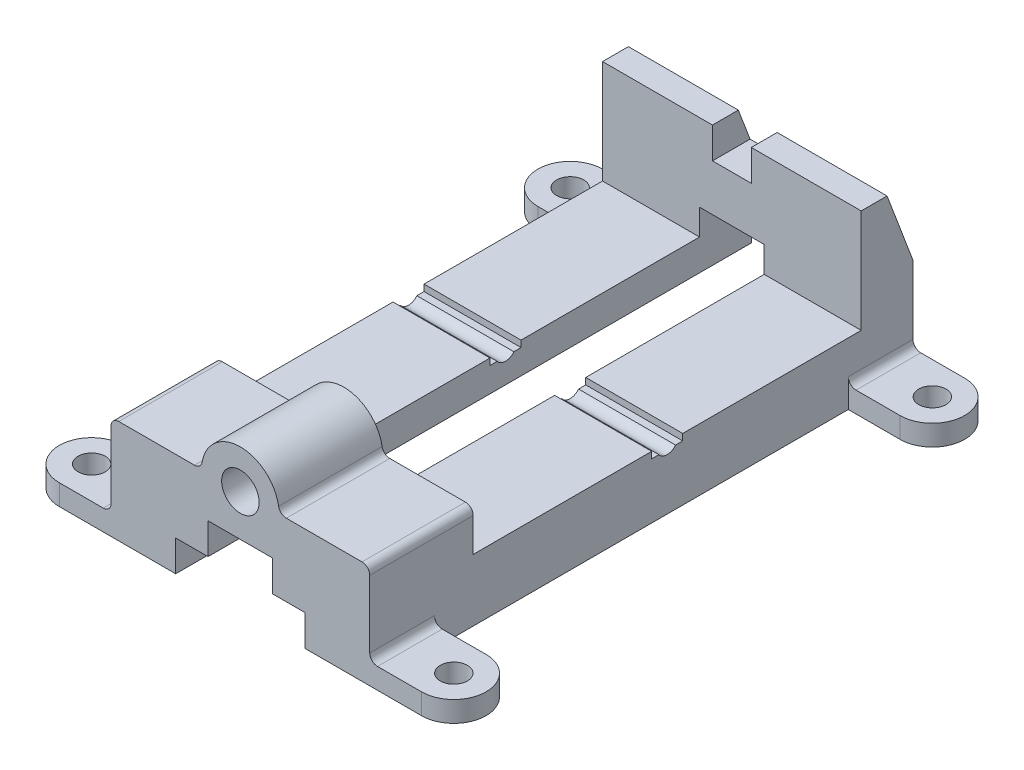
ISO-10303-21;
HEADER;
FILE_DESCRIPTION(('STEP AP214'),'2;1');
FILE_NAME('part.step','',(''),(''),'','','');
FILE_SCHEMA(('AUTOMOTIVE_DESIGN { 1 0 10303 214 1 1 1 1 }'));
ENDSEC;
DATA;
#1=APPLICATION_CONTEXT('core data for automotive mechanical design processes');
#2=APPLICATION_PROTOCOL_DEFINITION('international standard','automotive_design',2000,#1);
#3=PRODUCT_CONTEXT('',#1,'mechanical');
#4=PRODUCT('Part','Part','',(#3));
#5=PRODUCT_RELATED_PRODUCT_CATEGORY('part','',(#4));
#6=PRODUCT_DEFINITION_FORMATION('','',#4);
#7=PRODUCT_DEFINITION_CONTEXT('part definition',#1,'design');
#8=PRODUCT_DEFINITION('design','',#6,#7);
#9=PRODUCT_DEFINITION_SHAPE('','',#8);
#10=(LENGTH_UNIT() NAMED_UNIT(*) SI_UNIT(.MILLI.,.METRE.));
#11=(NAMED_UNIT(*) PLANE_ANGLE_UNIT() SI_UNIT($,.RADIAN.));
#12=(NAMED_UNIT(*) SI_UNIT($,.STERADIAN.) SOLID_ANGLE_UNIT());
#13=UNCERTAINTY_MEASURE_WITH_UNIT(LENGTH_MEASURE(1.E-05),#10,'distance_accuracy_value','');
#14=(GEOMETRIC_REPRESENTATION_CONTEXT(3) GLOBAL_UNCERTAINTY_ASSIGNED_CONTEXT((#13)) GLOBAL_UNIT_ASSIGNED_CONTEXT((#10,
#11,#12)) REPRESENTATION_CONTEXT('',''));
#15=CARTESIAN_POINT('',(0.,0.,0.));
#16=DIRECTION('',(0.,0.,1.));
#17=DIRECTION('',(1.,0.,0.));
#18=AXIS2_PLACEMENT_3D('',#15,#16,#17);
#19=CARTESIAN_POINT('',(-50.,64.,-210.));
#20=DIRECTION('',(0.,1.,0.));
#21=DIRECTION('',(0.,0.,1.));
#22=AXIS2_PLACEMENT_3D('',#19,#20,#21);
#23=PLANE('',#22);
#24=DIRECTION('',(0.,0.,-1.));
#25=VECTOR('',#24,1.);
#26=CARTESIAN_POINT('',(7.5,64.,-210.));
#27=LINE('',#26,#25);
#28=CARTESIAN_POINT('',(7.5,64.,-190.));
#29=VERTEX_POINT('',#28);
#30=CARTESIAN_POINT('',(7.5,64.,-200.));
#31=VERTEX_POINT('',#30);
#32=EDGE_CURVE('E407',#29,#31,#27,.T.);
#33=ORIENTED_EDGE('',*,*,#32,.F.);
#34=DIRECTION('',(-1.,0.,0.));
#35=VECTOR('',#34,1.);
#36=CARTESIAN_POINT('',(-50.,64.,-190.));
#37=LINE('',#36,#35);
#38=CARTESIAN_POINT('',(50.,64.,-190.));
#39=VERTEX_POINT('',#38);
#40=EDGE_CURVE('E423',#39,#29,#37,.T.);
#41=ORIENTED_EDGE('',*,*,#40,.F.);
#42=DIRECTION('',(0.,0.,1.));
#43=VECTOR('',#42,1.);
#44=CARTESIAN_POINT('',(50.,64.,-210.));
#45=LINE('',#44,#43);
#46=CARTESIAN_POINT('',(50.,64.,-200.));
#47=VERTEX_POINT('',#46);
#48=EDGE_CURVE('E426',#47,#39,#45,.T.);
#49=ORIENTED_EDGE('',*,*,#48,.F.);
#50=DIRECTION('',(1.,0.,0.));
#51=VECTOR('',#50,1.);
#52=CARTESIAN_POINT('',(-50.,64.,-200.));
#53=LINE('',#52,#51);
#54=EDGE_CURVE('E815',#31,#47,#53,.T.);
#55=ORIENTED_EDGE('',*,*,#54,.F.);
#56=EDGE_LOOP('',(#33,#41,#49,#55));
#57=FACE_BOUND('',#56,.T.);
#58=ADVANCED_FACE('F32',(#57),#23,.T.);
#59=CARTESIAN_POINT('',(-50.001,24.,-40.));
#60=DIRECTION('',(0.,-1.,0.));
#61=DIRECTION('',(0.,0.,-1.));
#62=AXIS2_PLACEMENT_3D('',#59,#60,#61);
#63=PLANE('',#62);
#64=DIRECTION('',(0.,0.,-1.));
#65=VECTOR('',#64,1.);
#66=CARTESIAN_POINT('',(50.,24.,-40.));
#67=LINE('',#66,#65);
#68=CARTESIAN_POINT('',(50.,24.,-40.));
#69=VERTEX_POINT('',#68);
#70=CARTESIAN_POINT('',(50.,24.,-109.));
#71=VERTEX_POINT('',#70);
#72=EDGE_CURVE('E449',#69,#71,#67,.T.);
#73=ORIENTED_EDGE('',*,*,#72,.T.);
#74=DIRECTION('',(1.,0.,0.));
#75=VECTOR('',#74,1.);
#76=CARTESIAN_POINT('',(-82.5,24.,-109.));
#77=LINE('',#76,#75);
#78=CARTESIAN_POINT('',(12.5,24.,-109.));
#79=VERTEX_POINT('',#78);
#80=EDGE_CURVE('E1248',#79,#71,#77,.T.);
#81=ORIENTED_EDGE('',*,*,#80,.F.);
#82=DIRECTION('',(0.,0.,1.));
#83=VECTOR('',#82,1.);
#84=CARTESIAN_POINT('',(12.5,24.,-210.));
#85=LINE('',#84,#83);
#86=CARTESIAN_POINT('',(12.5,24.,-40.));
#87=VERTEX_POINT('',#86);
#88=EDGE_CURVE('E468',#79,#87,#85,.T.);
#89=ORIENTED_EDGE('',*,*,#88,.T.);
#90=DIRECTION('',(1.,0.,0.));
#91=VECTOR('',#90,1.);
#92=CARTESIAN_POINT('',(-50.001,24.,-40.));
#93=LINE('',#92,#91);
#94=EDGE_CURVE('E455',#87,#69,#93,.T.);
#95=ORIENTED_EDGE('',*,*,#94,.T.);
#96=EDGE_LOOP('',(#73,#81,#89,#95));
#97=FACE_BOUND('',#96,.T.);
#98=ADVANCED_FACE('F918',(#97),#63,.F.);
#99=DIRECTION('',(0.,0.,1.));
#100=VECTOR('',#99,1.);
#101=CARTESIAN_POINT('',(-12.5,24.,-210.));
#102=LINE('',#101,#100);
#103=CARTESIAN_POINT('',(-12.5,24.,-109.));
#104=VERTEX_POINT('',#103);
#105=CARTESIAN_POINT('',(-12.5,24.,-40.));
#106=VERTEX_POINT('',#105);
#107=EDGE_CURVE('E548',#104,#106,#102,.T.);
#108=ORIENTED_EDGE('',*,*,#107,.F.);
#109=DIRECTION('',(-1.,0.,0.));
#110=VECTOR('',#109,1.);
#111=CARTESIAN_POINT('',(-50.001,24.,-109.));
#112=LINE('',#111,#110);
#113=CARTESIAN_POINT('',(-50.,24.,-109.));
#114=VERTEX_POINT('',#113);
#115=EDGE_CURVE('E807',#104,#114,#112,.T.);
#116=ORIENTED_EDGE('',*,*,#115,.T.);
#117=DIRECTION('',(0.,0.,-1.));
#118=VECTOR('',#117,1.);
#119=CARTESIAN_POINT('',(-50.,24.,-40.));
#120=LINE('',#119,#118);
#121=CARTESIAN_POINT('',(-50.,24.,-40.));
#122=VERTEX_POINT('',#121);
#123=EDGE_CURVE('E465',#122,#114,#120,.T.);
#124=ORIENTED_EDGE('',*,*,#123,.F.);
#125=EDGE_CURVE('E461',#122,#106,#93,.T.);
#126=ORIENTED_EDGE('',*,*,#125,.T.);
#127=EDGE_LOOP('',(#108,#116,#124,#126));
#128=FACE_BOUND('',#127,.T.);
#129=ADVANCED_FACE('F622',(#128),#63,.F.);
#130=CARTESIAN_POINT('',(70.,8.,-197.5));
#131=DIRECTION('',(0.,-1.,0.));
#132=DIRECTION('',(0.,0.,-1.));
#133=AXIS2_PLACEMENT_3D('',#130,#131,#132);
#134=PLANE('',#133);
#135=DIRECTION('',(-1.,0.,0.));
#136=VECTOR('',#135,1.);
#137=CARTESIAN_POINT('',(50.,8.,-210.));
#138=LINE('',#137,#136);
#139=CARTESIAN_POINT('',(70.,8.,-210.));
#140=VERTEX_POINT('',#139);
#141=CARTESIAN_POINT('',(53.,8.,-210.));
#142=VERTEX_POINT('',#141);
#143=EDGE_CURVE('E742',#140,#142,#138,.T.);
#144=ORIENTED_EDGE('',*,*,#143,.T.);
#145=DIRECTION('',(0.,0.,1.));
#146=VECTOR('',#145,1.);
#147=CARTESIAN_POINT('',(53.,8.,-197.5));
#148=LINE('',#147,#146);
#149=CARTESIAN_POINT('',(53.,8.,-185.));
#150=VERTEX_POINT('',#149);
#151=EDGE_CURVE('E504',#142,#150,#148,.T.);
#152=ORIENTED_EDGE('',*,*,#151,.T.);
#153=DIRECTION('',(1.,0.,0.));
#154=VECTOR('',#153,1.);
#155=CARTESIAN_POINT('',(70.,8.,-185.));
#156=LINE('',#155,#154);
#157=CARTESIAN_POINT('',(70.,8.,-185.));
#158=VERTEX_POINT('',#157);
#159=EDGE_CURVE('E745',#150,#158,#156,.T.);
#160=ORIENTED_EDGE('',*,*,#159,.T.);
#161=CARTESIAN_POINT('',(70.,8.,-197.5));
#162=DIRECTION('',(0.,1.,0.));
#163=DIRECTION('',(0.,0.,-1.));
#164=AXIS2_PLACEMENT_3D('',#161,#162,#163);
#165=CIRCLE('',#164,12.5);
#166=EDGE_CURVE('E737',#158,#140,#165,.T.);
#167=ORIENTED_EDGE('',*,*,#166,.T.);
#168=EDGE_LOOP('',(#144,#152,#160,#167));
#169=FACE_BOUND('',#168,.T.);
#170=CARTESIAN_POINT('',(70.,8.,-197.5));
#171=DIRECTION('',(0.,1.,0.));
#172=DIRECTION('',(0.,0.,1.));
#173=AXIS2_PLACEMENT_3D('',#170,#171,#172);
#174=CIRCLE('',#173,5.25);
#175=CARTESIAN_POINT('',(70.,8.,-192.25));
#176=VERTEX_POINT('',#175);
#177=EDGE_CURVE('E859',#176,#176,#174,.T.);
#178=ORIENTED_EDGE('',*,*,#177,.F.);
#179=EDGE_LOOP('',(#178));
#180=FACE_BOUND('',#179,.T.);
#181=ADVANCED_FACE('F949',(#169,#180),#134,.F.);
#182=CARTESIAN_POINT('',(-70.,8.,-12.5));
#183=DIRECTION('',(0.,-1.,0.));
#184=DIRECTION('',(0.,0.,-1.));
#185=AXIS2_PLACEMENT_3D('',#182,#183,#184);
#186=PLANE('',#185);
#187=DIRECTION('',(1.,0.,0.));
#188=VECTOR('',#187,1.);
#189=CARTESIAN_POINT('',(-50.,8.,0.));
#190=LINE('',#189,#188);
#191=CARTESIAN_POINT('',(-70.,8.,0.));
#192=VERTEX_POINT('',#191);
#193=CARTESIAN_POINT('',(-53.,8.,0.));
#194=VERTEX_POINT('',#193);
#195=EDGE_CURVE('E531',#192,#194,#190,.T.);
#196=ORIENTED_EDGE('',*,*,#195,.T.);
#197=DIRECTION('',(0.,0.,-1.));
#198=VECTOR('',#197,1.);
#199=CARTESIAN_POINT('',(-53.,8.,-12.5));
#200=LINE('',#199,#198);
#201=CARTESIAN_POINT('',(-53.,8.,-25.));
#202=VERTEX_POINT('',#201);
#203=EDGE_CURVE('E1191',#194,#202,#200,.T.);
#204=ORIENTED_EDGE('',*,*,#203,.T.);
#205=DIRECTION('',(-1.,0.,0.));
#206=VECTOR('',#205,1.);
#207=CARTESIAN_POINT('',(-70.,8.,-25.));
#208=LINE('',#207,#206);
#209=CARTESIAN_POINT('',(-70.,8.,-25.));
#210=VERTEX_POINT('',#209);
#211=EDGE_CURVE('E718',#202,#210,#208,.T.);
#212=ORIENTED_EDGE('',*,*,#211,.T.);
#213=CARTESIAN_POINT('',(-70.,8.,-12.5));
#214=DIRECTION('',(0.,1.,0.));
#215=DIRECTION('',(0.,0.,-1.));
#216=AXIS2_PLACEMENT_3D('',#213,#214,#215);
#217=CIRCLE('',#216,12.5);
#218=EDGE_CURVE('E710',#210,#192,#217,.T.);
#219=ORIENTED_EDGE('',*,*,#218,.T.);
#220=EDGE_LOOP('',(#196,#204,#212,#219));
#221=FACE_BOUND('',#220,.T.);
#222=CARTESIAN_POINT('',(-70.,8.,-12.5));
#223=DIRECTION('',(0.,1.,0.));
#224=DIRECTION('',(0.,0.,1.));
#225=AXIS2_PLACEMENT_3D('',#222,#223,#224);
#226=CIRCLE('',#225,5.25);
#227=CARTESIAN_POINT('',(-70.,8.,-7.25));
#228=VERTEX_POINT('',#227);
#229=EDGE_CURVE('E871',#228,#228,#226,.T.);
#230=ORIENTED_EDGE('',*,*,#229,.F.);
#231=EDGE_LOOP('',(#230));
#232=FACE_BOUND('',#231,.T.);
#233=ADVANCED_FACE('F953',(#221,#232),#186,.F.);
#234=CARTESIAN_POINT('',(-50.,0.,-210.));
#235=DIRECTION('',(-1.,0.,0.));
#236=DIRECTION('',(0.,0.,1.));
#237=AXIS2_PLACEMENT_3D('',#234,#235,#236);
#238=PLANE('',#237);
#239=DIRECTION('',(0.,0.935601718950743,0.353057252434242));
#240=VECTOR('',#239,1.);
#241=CARTESIAN_POINT('',(-50.,4.67435338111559,-222.387036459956));
#242=LINE('',#241,#240);
#243=CARTESIAN_POINT('',(-50.,37.5,-210.));
#244=VERTEX_POINT('',#243);
#245=CARTESIAN_POINT('',(-50.,64.,-200.));
#246=VERTEX_POINT('',#245);
#247=EDGE_CURVE('E55',#244,#246,#242,.T.);
#248=ORIENTED_EDGE('',*,*,#247,.F.);
#249=DIRECTION('',(0.,-1.,0.));
#250=VECTOR('',#249,1.);
#251=CARTESIAN_POINT('',(-50.,0.,-210.));
#252=LINE('',#251,#250);
#253=CARTESIAN_POINT('',(-50.,11.,-210.));
#254=VERTEX_POINT('',#253);
#255=EDGE_CURVE('E670',#244,#254,#252,.T.);
#256=ORIENTED_EDGE('',*,*,#255,.T.);
#257=DIRECTION('',(0.,0.,-1.));
#258=VECTOR('',#257,1.);
#259=CARTESIAN_POINT('',(-50.,11.,-185.));
#260=LINE('',#259,#258);
#261=CARTESIAN_POINT('',(-50.,11.,-185.));
#262=VERTEX_POINT('',#261);
#263=EDGE_CURVE('E895',#254,#262,#260,.F.);
#264=ORIENTED_EDGE('',*,*,#263,.T.);
#265=DIRECTION('',(0.,-1.,0.));
#266=VECTOR('',#265,1.);
#267=CARTESIAN_POINT('',(-50.,8.,-185.));
#268=LINE('',#267,#266);
#269=CARTESIAN_POINT('',(-50.,0.,-185.));
#270=VERTEX_POINT('',#269);
#271=EDGE_CURVE('E712',#262,#270,#268,.T.);
#272=ORIENTED_EDGE('',*,*,#271,.T.);
#273=DIRECTION('',(0.,0.,1.));
#274=VECTOR('',#273,1.);
#275=CARTESIAN_POINT('',(-50.,0.,-210.));
#276=LINE('',#275,#274);
#277=CARTESIAN_POINT('',(-50.,0.,-25.));
#278=VERTEX_POINT('',#277);
#279=EDGE_CURVE('E529',#270,#278,#276,.T.);
#280=ORIENTED_EDGE('',*,*,#279,.T.);
#281=DIRECTION('',(0.,-1.,0.));
#282=VECTOR('',#281,1.);
#283=CARTESIAN_POINT('',(-50.,8.,-25.));
#284=LINE('',#283,#282);
#285=CARTESIAN_POINT('',(-50.,11.,-25.));
#286=VERTEX_POINT('',#285);
#287=EDGE_CURVE('E722',#286,#278,#284,.T.);
#288=ORIENTED_EDGE('',*,*,#287,.F.);
#289=DIRECTION('',(0.,0.,-1.));
#290=VECTOR('',#289,1.);
#291=CARTESIAN_POINT('',(-50.,11.,-210.));
#292=LINE('',#291,#290);
#293=CARTESIAN_POINT('',(-50.,11.,0.));
#294=VERTEX_POINT('',#293);
#295=EDGE_CURVE('E1194',#286,#294,#292,.F.);
#296=ORIENTED_EDGE('',*,*,#295,.T.);
#297=DIRECTION('',(0.,-1.,0.));
#298=VECTOR('',#297,1.);
#299=CARTESIAN_POINT('',(-50.,0.,0.));
#300=LINE('',#299,#298);
#301=CARTESIAN_POINT('',(-50.,37.,0.));
#302=VERTEX_POINT('',#301);
#303=EDGE_CURVE('E688',#302,#294,#300,.T.);
#304=ORIENTED_EDGE('',*,*,#303,.F.);
#305=DIRECTION('',(0.,0.,1.));
#306=VECTOR('',#305,1.);
#307=CARTESIAN_POINT('',(-50.,37.,-210.));
#308=LINE('',#307,#306);
#309=CARTESIAN_POINT('',(-50.,37.,-40.));
#310=VERTEX_POINT('',#309);
#311=EDGE_CURVE('E678',#302,#310,#308,.F.);
#312=ORIENTED_EDGE('',*,*,#311,.T.);
#313=DIRECTION('',(0.,-1.,0.));
#314=VECTOR('',#313,1.);
#315=CARTESIAN_POINT('',(-50.,24.,-40.));
#316=LINE('',#315,#314);
#317=EDGE_CURVE('E438',#310,#122,#316,.T.);
#318=ORIENTED_EDGE('',*,*,#317,.T.);
#319=ORIENTED_EDGE('',*,*,#123,.T.);
#320=DIRECTION('',(0.,1.,0.));
#321=VECTOR('',#320,1.);
#322=CARTESIAN_POINT('',(-50.,0.,-109.));
#323=LINE('',#322,#321);
#324=CARTESIAN_POINT('',(-50.,21.5,-109.));
#325=VERTEX_POINT('',#324);
#326=EDGE_CURVE('E840',#325,#114,#323,.T.);
#327=ORIENTED_EDGE('',*,*,#326,.F.);
#328=DIRECTION('',(0.,0.,1.));
#329=VECTOR('',#328,1.);
#330=CARTESIAN_POINT('',(-50.,21.5,-210.));
#331=LINE('',#330,#329);
#332=CARTESIAN_POINT('',(-50.,21.5,-111.773887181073));
#333=VERTEX_POINT('',#332);
#334=EDGE_CURVE('E847',#333,#325,#331,.T.);
#335=ORIENTED_EDGE('',*,*,#334,.F.);
#336=CARTESIAN_POINT('',(-50.,24.,-115.));
#337=DIRECTION('',(-1.,0.,0.));
#338=DIRECTION('',(0.,0.,1.));
#339=AXIS2_PLACEMENT_3D('',#336,#337,#338);
#340=CIRCLE('',#339,4.08139729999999);
#341=CARTESIAN_POINT('',(-50.,21.5,-118.226112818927));
#342=VERTEX_POINT('',#341);
#343=EDGE_CURVE('E851',#342,#333,#340,.T.);
#344=ORIENTED_EDGE('',*,*,#343,.F.);
#345=DIRECTION('',(0.,0.,1.));
#346=VECTOR('',#345,1.);
#347=CARTESIAN_POINT('',(-50.,21.5,-210.));
#348=LINE('',#347,#346);
#349=CARTESIAN_POINT('',(-50.,21.5,-121.));
#350=VERTEX_POINT('',#349);
#351=EDGE_CURVE('E827',#350,#342,#348,.T.);
#352=ORIENTED_EDGE('',*,*,#351,.F.);
#353=DIRECTION('',(0.,-1.,0.));
#354=VECTOR('',#353,1.);
#355=CARTESIAN_POINT('',(-50.,0.,-121.));
#356=LINE('',#355,#354);
#357=CARTESIAN_POINT('',(-50.,24.,-121.));
#358=VERTEX_POINT('',#357);
#359=EDGE_CURVE('E825',#358,#350,#356,.T.);
#360=ORIENTED_EDGE('',*,*,#359,.F.);
#361=CARTESIAN_POINT('',(-50.,24.,-190.));
#362=VERTEX_POINT('',#361);
#363=EDGE_CURVE('E459',#358,#362,#120,.T.);
#364=ORIENTED_EDGE('',*,*,#363,.T.);
#365=DIRECTION('',(0.,1.,0.));
#366=VECTOR('',#365,1.);
#367=CARTESIAN_POINT('',(-50.,24.,-190.));
#368=LINE('',#367,#366);
#369=CARTESIAN_POINT('',(-50.,64.,-190.));
#370=VERTEX_POINT('',#369);
#371=EDGE_CURVE('E436',#362,#370,#368,.T.);
#372=ORIENTED_EDGE('',*,*,#371,.T.);
#373=DIRECTION('',(0.,0.,1.));
#374=VECTOR('',#373,1.);
#375=CARTESIAN_POINT('',(-50.,64.,-210.));
#376=LINE('',#375,#374);
#377=EDGE_CURVE('E421',#246,#370,#376,.T.);
#378=ORIENTED_EDGE('',*,*,#377,.F.);
#379=EDGE_LOOP('',(#248,#256,#264,#272,#280,#288,#296,#304,#312,#318,#319,#327,#335,#344,#352,
#360,#364,#372,#378));
#380=FACE_BOUND('',#379,.T.);
#381=ADVANCED_FACE('F821',(#380),#238,.T.);
#382=CARTESIAN_POINT('',(50.,0.,-210.));
#383=DIRECTION('',(1.,0.,0.));
#384=DIRECTION('',(0.,0.,-1.));
#385=AXIS2_PLACEMENT_3D('',#382,#383,#384);
#386=PLANE('',#385);
#387=DIRECTION('',(0.,-0.935601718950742,-0.353057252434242));
#388=VECTOR('',#387,1.);
#389=CARTESIAN_POINT('',(50.,64.,-200.));
#390=LINE('',#389,#388);
#391=CARTESIAN_POINT('',(50.,37.5,-210.));
#392=VERTEX_POINT('',#391);
#393=EDGE_CURVE('E1308',#47,#392,#390,.T.);
#394=ORIENTED_EDGE('',*,*,#393,.F.);
#395=ORIENTED_EDGE('',*,*,#48,.T.);
#396=DIRECTION('',(0.,1.,0.));
#397=VECTOR('',#396,1.);
#398=CARTESIAN_POINT('',(50.,24.,-190.));
#399=LINE('',#398,#397);
#400=CARTESIAN_POINT('',(50.,24.,-190.));
#401=VERTEX_POINT('',#400);
#402=EDGE_CURVE('E452',#401,#39,#399,.T.);
#403=ORIENTED_EDGE('',*,*,#402,.F.);
#404=CARTESIAN_POINT('',(50.,24.,-121.));
#405=VERTEX_POINT('',#404);
#406=EDGE_CURVE('E448',#405,#401,#67,.T.);
#407=ORIENTED_EDGE('',*,*,#406,.F.);
#408=DIRECTION('',(0.,1.,0.));
#409=VECTOR('',#408,1.);
#410=CARTESIAN_POINT('',(50.,21.5,-121.));
#411=LINE('',#410,#409);
#412=CARTESIAN_POINT('',(50.,21.5,-121.));
#413=VERTEX_POINT('',#412);
#414=EDGE_CURVE('E1288',#413,#405,#411,.T.);
#415=ORIENTED_EDGE('',*,*,#414,.F.);
#416=DIRECTION('',(0.,0.,-1.));
#417=VECTOR('',#416,1.);
#418=CARTESIAN_POINT('',(50.,21.5,-118.226112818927));
#419=LINE('',#418,#417);
#420=CARTESIAN_POINT('',(50.,21.5,-118.226112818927));
#421=VERTEX_POINT('',#420);
#422=EDGE_CURVE('E1286',#421,#413,#419,.T.);
#423=ORIENTED_EDGE('',*,*,#422,.F.);
#424=CARTESIAN_POINT('',(50.,24.,-115.));
#425=DIRECTION('',(1.,0.,0.));
#426=DIRECTION('',(0.,0.,-1.));
#427=AXIS2_PLACEMENT_3D('',#424,#425,#426);
#428=CIRCLE('',#427,4.08139729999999);
#429=CARTESIAN_POINT('',(50.,21.5,-111.773887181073));
#430=VERTEX_POINT('',#429);
#431=EDGE_CURVE('E1282',#430,#421,#428,.T.);
#432=ORIENTED_EDGE('',*,*,#431,.F.);
#433=DIRECTION('',(0.,0.,-1.));
#434=VECTOR('',#433,1.);
#435=CARTESIAN_POINT('',(50.,21.5,-111.773887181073));
#436=LINE('',#435,#434);
#437=CARTESIAN_POINT('',(50.,21.5,-109.));
#438=VERTEX_POINT('',#437);
#439=EDGE_CURVE('E1272',#438,#430,#436,.T.);
#440=ORIENTED_EDGE('',*,*,#439,.F.);
#441=DIRECTION('',(0.,-1.,0.));
#442=VECTOR('',#441,1.);
#443=CARTESIAN_POINT('',(50.,21.5,-109.));
#444=LINE('',#443,#442);
#445=EDGE_CURVE('E1246',#71,#438,#444,.T.);
#446=ORIENTED_EDGE('',*,*,#445,.F.);
#447=ORIENTED_EDGE('',*,*,#72,.F.);
#448=DIRECTION('',(0.,-1.,0.));
#449=VECTOR('',#448,1.);
#450=CARTESIAN_POINT('',(50.,24.,-40.));
#451=LINE('',#450,#449);
#452=CARTESIAN_POINT('',(50.,37.,-40.));
#453=VERTEX_POINT('',#452);
#454=EDGE_CURVE('E446',#453,#69,#451,.T.);
#455=ORIENTED_EDGE('',*,*,#454,.F.);
#456=DIRECTION('',(0.,0.,1.));
#457=VECTOR('',#456,1.);
#458=CARTESIAN_POINT('',(50.,37.,-210.));
#459=LINE('',#458,#457);
#460=CARTESIAN_POINT('',(50.,37.,0.));
#461=VERTEX_POINT('',#460);
#462=EDGE_CURVE('E506',#453,#461,#459,.T.);
#463=ORIENTED_EDGE('',*,*,#462,.T.);
#464=DIRECTION('',(0.,1.,0.));
#465=VECTOR('',#464,1.);
#466=CARTESIAN_POINT('',(50.,0.,0.));
#467=LINE('',#466,#465);
#468=CARTESIAN_POINT('',(50.,11.,0.));
#469=VERTEX_POINT('',#468);
#470=EDGE_CURVE('E495',#469,#461,#467,.T.);
#471=ORIENTED_EDGE('',*,*,#470,.F.);
#472=DIRECTION('',(0.,0.,1.));
#473=VECTOR('',#472,1.);
#474=CARTESIAN_POINT('',(50.,11.,-25.));
#475=LINE('',#474,#473);
#476=CARTESIAN_POINT('',(50.,11.,-25.));
#477=VERTEX_POINT('',#476);
#478=EDGE_CURVE('E509',#469,#477,#475,.F.);
#479=ORIENTED_EDGE('',*,*,#478,.T.);
#480=DIRECTION('',(0.,-1.,0.));
#481=VECTOR('',#480,1.);
#482=CARTESIAN_POINT('',(50.,8.,-25.));
#483=LINE('',#482,#481);
#484=CARTESIAN_POINT('',(50.,0.,-25.));
#485=VERTEX_POINT('',#484);
#486=EDGE_CURVE('E554',#477,#485,#483,.T.);
#487=ORIENTED_EDGE('',*,*,#486,.T.);
#488=DIRECTION('',(0.,0.,1.));
#489=VECTOR('',#488,1.);
#490=CARTESIAN_POINT('',(50.,0.,-210.));
#491=LINE('',#490,#489);
#492=CARTESIAN_POINT('',(50.,0.,-185.));
#493=VERTEX_POINT('',#492);
#494=EDGE_CURVE('E526',#493,#485,#491,.T.);
#495=ORIENTED_EDGE('',*,*,#494,.F.);
#496=DIRECTION('',(0.,-1.,0.));
#497=VECTOR('',#496,1.);
#498=CARTESIAN_POINT('',(50.,8.,-185.));
#499=LINE('',#498,#497);
#500=CARTESIAN_POINT('',(50.,11.,-185.));
#501=VERTEX_POINT('',#500);
#502=EDGE_CURVE('E749',#501,#493,#499,.T.);
#503=ORIENTED_EDGE('',*,*,#502,.F.);
#504=DIRECTION('',(0.,0.,1.));
#505=VECTOR('',#504,1.);
#506=CARTESIAN_POINT('',(50.,11.,-210.));
#507=LINE('',#506,#505);
#508=CARTESIAN_POINT('',(50.,11.,-210.));
#509=VERTEX_POINT('',#508);
#510=EDGE_CURVE('E512',#501,#509,#507,.F.);
#511=ORIENTED_EDGE('',*,*,#510,.T.);
#512=DIRECTION('',(0.,1.,0.));
#513=VECTOR('',#512,1.);
#514=CARTESIAN_POINT('',(50.,0.,-210.));
#515=LINE('',#514,#513);
#516=EDGE_CURVE('E667',#509,#392,#515,.T.);
#517=ORIENTED_EDGE('',*,*,#516,.T.);
#518=EDGE_LOOP('',(#394,#395,#403,#407,#415,#423,#432,#440,#446,#447,#455,#463,#471,#479,#487,
#495,#503,#511,#517));
#519=FACE_BOUND('',#518,.T.);
#520=ADVANCED_FACE('F992',(#519),#386,.T.);
#521=CARTESIAN_POINT('',(0.,40.,0.));
#522=DIRECTION('',(0.,0.,-1.));
#523=DIRECTION('',(-1.,0.,0.));
#524=AXIS2_PLACEMENT_3D('',#521,#522,#523);
#525=PLANE('',#524);
#526=ORIENTED_EDGE('',*,*,#470,.T.);
#527=CARTESIAN_POINT('',(47.,37.,0.));
#528=DIRECTION('',(0.,0.,-1.));
#529=DIRECTION('',(-1.,0.,0.));
#530=AXIS2_PLACEMENT_3D('',#527,#528,#529);
#531=CIRCLE('',#530,3.);
#532=CARTESIAN_POINT('',(47.,40.,0.));
#533=VERTEX_POINT('',#532);
#534=EDGE_CURVE('E773',#461,#533,#531,.F.);
#535=ORIENTED_EDGE('',*,*,#534,.T.);
#536=DIRECTION('',(-1.,0.,0.));
#537=VECTOR('',#536,1.);
#538=CARTESIAN_POINT('',(50.,40.,0.));
#539=LINE('',#538,#537);
#540=CARTESIAN_POINT('',(17.7482393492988,40.,0.));
#541=VERTEX_POINT('',#540);
#542=EDGE_CURVE('E498',#533,#541,#539,.T.);
#543=ORIENTED_EDGE('',*,*,#542,.T.);
#544=CARTESIAN_POINT('',(17.7482393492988,43.,0.));
#545=DIRECTION('',(0.,0.,-1.));
#546=DIRECTION('',(-1.,0.,0.));
#547=AXIS2_PLACEMENT_3D('',#544,#545,#546);
#548=CIRCLE('',#547,3.);
#549=CARTESIAN_POINT('',(14.790199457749,42.5,0.));
#550=VERTEX_POINT('',#549);
#551=EDGE_CURVE('E795',#541,#550,#548,.T.);
#552=ORIENTED_EDGE('',*,*,#551,.T.);
#553=CARTESIAN_POINT('',(0.,40.,0.));
#554=DIRECTION('',(0.,0.,1.));
#555=DIRECTION('',(-1.,0.,0.));
#556=AXIS2_PLACEMENT_3D('',#553,#554,#555);
#557=CIRCLE('',#556,15.);
#558=CARTESIAN_POINT('',(-14.790199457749,42.5,0.));
#559=VERTEX_POINT('',#558);
#560=EDGE_CURVE('E1240',#550,#559,#557,.T.);
#561=ORIENTED_EDGE('',*,*,#560,.T.);
#562=CARTESIAN_POINT('',(-17.7482393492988,43.,0.));
#563=DIRECTION('',(0.,0.,-1.));
#564=DIRECTION('',(-1.,0.,0.));
#565=AXIS2_PLACEMENT_3D('',#562,#563,#564);
#566=CIRCLE('',#565,3.);
#567=CARTESIAN_POINT('',(-17.7482393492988,40.,0.));
#568=VERTEX_POINT('',#567);
#569=EDGE_CURVE('E791',#559,#568,#566,.T.);
#570=ORIENTED_EDGE('',*,*,#569,.T.);
#571=DIRECTION('',(-1.,0.,0.));
#572=VECTOR('',#571,1.);
#573=CARTESIAN_POINT('',(-50.,40.,0.));
#574=LINE('',#573,#572);
#575=CARTESIAN_POINT('',(-47.,40.,0.));
#576=VERTEX_POINT('',#575);
#577=EDGE_CURVE('E692',#568,#576,#574,.T.);
#578=ORIENTED_EDGE('',*,*,#577,.T.);
#579=CARTESIAN_POINT('',(-47.,37.,0.));
#580=DIRECTION('',(0.,0.,-1.));
#581=DIRECTION('',(-1.,0.,0.));
#582=AXIS2_PLACEMENT_3D('',#579,#580,#581);
#583=CIRCLE('',#582,3.);
#584=EDGE_CURVE('E772',#576,#302,#583,.F.);
#585=ORIENTED_EDGE('',*,*,#584,.T.);
#586=ORIENTED_EDGE('',*,*,#303,.T.);
#587=CARTESIAN_POINT('',(-53.,11.,0.));
#588=DIRECTION('',(0.,0.,-1.));
#589=DIRECTION('',(-1.,0.,0.));
#590=AXIS2_PLACEMENT_3D('',#587,#588,#589);
#591=CIRCLE('',#590,3.);
#592=EDGE_CURVE('E789',#294,#194,#591,.T.);
#593=ORIENTED_EDGE('',*,*,#592,.T.);
#594=ORIENTED_EDGE('',*,*,#195,.F.);
#595=DIRECTION('',(0.,-1.,0.));
#596=VECTOR('',#595,1.);
#597=CARTESIAN_POINT('',(-70.,8.,0.));
#598=LINE('',#597,#596);
#599=CARTESIAN_POINT('',(-70.,0.,0.));
#600=VERTEX_POINT('',#599);
#601=EDGE_CURVE('E699',#192,#600,#598,.T.);
#602=ORIENTED_EDGE('',*,*,#601,.T.);
#603=DIRECTION('',(1.,0.,0.));
#604=VECTOR('',#603,1.);
#605=CARTESIAN_POINT('',(-25.,0.,0.));
#606=LINE('',#605,#604);
#607=CARTESIAN_POINT('',(-25.,0.,0.));
#608=VERTEX_POINT('',#607);
#609=EDGE_CURVE('E654',#600,#608,#606,.T.);
#610=ORIENTED_EDGE('',*,*,#609,.T.);
#611=DIRECTION('',(0.,1.,0.));
#612=VECTOR('',#611,1.);
#613=CARTESIAN_POINT('',(-25.,0.,0.));
#614=LINE('',#613,#612);
#615=CARTESIAN_POINT('',(-25.,12.,0.));
#616=VERTEX_POINT('',#615);
#617=EDGE_CURVE('E472',#608,#616,#614,.T.);
#618=ORIENTED_EDGE('',*,*,#617,.T.);
#619=DIRECTION('',(1.,0.,0.));
#620=VECTOR('',#619,1.);
#621=CARTESIAN_POINT('',(-25.,12.,0.));
#622=LINE('',#621,#620);
#623=CARTESIAN_POINT('',(-12.5,12.,0.));
#624=VERTEX_POINT('',#623);
#625=EDGE_CURVE('E475',#616,#624,#622,.T.);
#626=ORIENTED_EDGE('',*,*,#625,.T.);
#627=DIRECTION('',(0.,1.,0.));
#628=VECTOR('',#627,1.);
#629=CARTESIAN_POINT('',(-12.5,12.,0.));
#630=LINE('',#629,#628);
#631=CARTESIAN_POINT('',(-12.5,24.,0.));
#632=VERTEX_POINT('',#631);
#633=EDGE_CURVE('E478',#624,#632,#630,.T.);
#634=ORIENTED_EDGE('',*,*,#633,.T.);
#635=DIRECTION('',(1.,0.,0.));
#636=VECTOR('',#635,1.);
#637=CARTESIAN_POINT('',(-12.5,24.,0.));
#638=LINE('',#637,#636);
#639=CARTESIAN_POINT('',(12.5,24.,0.));
#640=VERTEX_POINT('',#639);
#641=EDGE_CURVE('E481',#632,#640,#638,.T.);
#642=ORIENTED_EDGE('',*,*,#641,.T.);
#643=DIRECTION('',(0.,-1.,0.));
#644=VECTOR('',#643,1.);
#645=CARTESIAN_POINT('',(12.5,12.,0.));
#646=LINE('',#645,#644);
#647=CARTESIAN_POINT('',(12.5,12.,0.));
#648=VERTEX_POINT('',#647);
#649=EDGE_CURVE('E484',#640,#648,#646,.T.);
#650=ORIENTED_EDGE('',*,*,#649,.T.);
#651=DIRECTION('',(1.,0.,0.));
#652=VECTOR('',#651,1.);
#653=CARTESIAN_POINT('',(25.,12.,0.));
#654=LINE('',#653,#652);
#655=CARTESIAN_POINT('',(25.,12.,0.));
#656=VERTEX_POINT('',#655);
#657=EDGE_CURVE('E487',#648,#656,#654,.T.);
#658=ORIENTED_EDGE('',*,*,#657,.T.);
#659=DIRECTION('',(0.,-1.,0.));
#660=VECTOR('',#659,1.);
#661=CARTESIAN_POINT('',(25.,0.,0.));
#662=LINE('',#661,#660);
#663=CARTESIAN_POINT('',(25.,0.,0.));
#664=VERTEX_POINT('',#663);
#665=EDGE_CURVE('E490',#656,#664,#662,.T.);
#666=ORIENTED_EDGE('',*,*,#665,.T.);
#667=DIRECTION('',(1.,0.,0.));
#668=VECTOR('',#667,1.);
#669=CARTESIAN_POINT('',(25.,0.,0.));
#670=LINE('',#669,#668);
#671=CARTESIAN_POINT('',(70.,0.,0.));
#672=VERTEX_POINT('',#671);
#673=EDGE_CURVE('E493',#664,#672,#670,.T.);
#674=ORIENTED_EDGE('',*,*,#673,.T.);
#675=DIRECTION('',(0.,-1.,0.));
#676=VECTOR('',#675,1.);
#677=CARTESIAN_POINT('',(70.,8.,0.));
#678=LINE('',#677,#676);
#679=CARTESIAN_POINT('',(70.,8.,0.));
#680=VERTEX_POINT('',#679);
#681=EDGE_CURVE('E565',#680,#672,#678,.T.);
#682=ORIENTED_EDGE('',*,*,#681,.F.);
#683=DIRECTION('',(1.,0.,0.));
#684=VECTOR('',#683,1.);
#685=CARTESIAN_POINT('',(50.,8.,0.));
#686=LINE('',#685,#684);
#687=CARTESIAN_POINT('',(53.,8.,0.));
#688=VERTEX_POINT('',#687);
#689=EDGE_CURVE('E515',#688,#680,#686,.T.);
#690=ORIENTED_EDGE('',*,*,#689,.F.);
#691=CARTESIAN_POINT('',(53.,11.,0.));
#692=DIRECTION('',(0.,0.,-1.));
#693=DIRECTION('',(-1.,0.,0.));
#694=AXIS2_PLACEMENT_3D('',#691,#692,#693);
#695=CIRCLE('',#694,3.);
#696=EDGE_CURVE('E771',#688,#469,#695,.T.);
#697=ORIENTED_EDGE('',*,*,#696,.T.);
#698=EDGE_LOOP('',(#526,#535,#543,#552,#561,#570,#578,#585,#586,#593,#594,#602,#610,#618,#626,
#634,#642,#650,#658,#666,#674,#682,#690,#697));
#699=FACE_BOUND('',#698,.T.);
#700=CARTESIAN_POINT('',(0.,40.,0.));
#701=DIRECTION('',(0.,0.,1.));
#702=DIRECTION('',(1.,0.,0.));
#703=AXIS2_PLACEMENT_3D('',#700,#701,#702);
#704=CIRCLE('',#703,7.24999999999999);
#705=CARTESIAN_POINT('',(7.24999999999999,40.,0.));
#706=VERTEX_POINT('',#705);
#707=EDGE_CURVE('E568',#706,#706,#704,.T.);
#708=ORIENTED_EDGE('',*,*,#707,.F.);
#709=EDGE_LOOP('',(#708));
#710=FACE_BOUND('',#709,.T.);
#711=ADVANCED_FACE('F635',(#699,#710),#525,.F.);
#712=CARTESIAN_POINT('',(-50.,40.,-210.));
#713=DIRECTION('',(0.,1.,0.));
#714=DIRECTION('',(0.,0.,1.));
#715=AXIS2_PLACEMENT_3D('',#712,#713,#714);
#716=PLANE('',#715);
#717=ORIENTED_EDGE('',*,*,#577,.F.);
#718=DIRECTION('',(0.,0.,-1.));
#719=VECTOR('',#718,1.);
#720=CARTESIAN_POINT('',(-17.7482393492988,40.,-40.));
#721=LINE('',#720,#719);
#722=CARTESIAN_POINT('',(-17.7482393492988,40.,-40.));
#723=VERTEX_POINT('',#722);
#724=EDGE_CURVE('E1206',#568,#723,#721,.T.);
#725=ORIENTED_EDGE('',*,*,#724,.T.);
#726=DIRECTION('',(-1.,0.,0.));
#727=VECTOR('',#726,1.);
#728=CARTESIAN_POINT('',(-50.001,40.,-40.));
#729=LINE('',#728,#727);
#730=CARTESIAN_POINT('',(-47.,40.,-40.));
#731=VERTEX_POINT('',#730);
#732=EDGE_CURVE('E443',#723,#731,#729,.T.);
#733=ORIENTED_EDGE('',*,*,#732,.T.);
#734=DIRECTION('',(0.,0.,1.));
#735=VECTOR('',#734,1.);
#736=CARTESIAN_POINT('',(-47.,40.,-210.));
#737=LINE('',#736,#735);
#738=EDGE_CURVE('E1203',#731,#576,#737,.T.);
#739=ORIENTED_EDGE('',*,*,#738,.T.);
#740=EDGE_LOOP('',(#717,#725,#733,#739));
#741=FACE_BOUND('',#740,.T.);
#742=ADVANCED_FACE('F991',(#741),#716,.T.);
#743=CARTESIAN_POINT('',(0.,40.,-210.));
#744=DIRECTION('',(0.,0.,1.));
#745=DIRECTION('',(1.,0.,0.));
#746=AXIS2_PLACEMENT_3D('',#743,#744,#745);
#747=CYLINDRICAL_SURFACE('',#746,15.);
#748=CARTESIAN_POINT('',(0.,40.,-40.));
#749=DIRECTION('',(0.,0.,1.));
#750=DIRECTION('',(0.,-1.,0.));
#751=AXIS2_PLACEMENT_3D('',#748,#749,#750);
#752=CIRCLE('',#751,15.);
#753=CARTESIAN_POINT('',(14.790199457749,42.5,-40.));
#754=VERTEX_POINT('',#753);
#755=CARTESIAN_POINT('',(-14.790199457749,42.5,-40.));
#756=VERTEX_POINT('',#755);
#757=EDGE_CURVE('E440',#754,#756,#752,.T.);
#758=ORIENTED_EDGE('',*,*,#757,.T.);
#759=DIRECTION('',(0.,0.,1.));
#760=VECTOR('',#759,1.);
#761=CARTESIAN_POINT('',(-14.790199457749,42.5,-210.));
#762=LINE('',#761,#760);
#763=EDGE_CURVE('E1200',#756,#559,#762,.T.);
#764=ORIENTED_EDGE('',*,*,#763,.T.);
#765=ORIENTED_EDGE('',*,*,#560,.F.);
#766=DIRECTION('',(0.,0.,1.));
#767=VECTOR('',#766,1.);
#768=CARTESIAN_POINT('',(14.790199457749,42.5,-210.));
#769=LINE('',#768,#767);
#770=EDGE_CURVE('E1198',#550,#754,#769,.F.);
#771=ORIENTED_EDGE('',*,*,#770,.T.);
#772=EDGE_LOOP('',(#758,#764,#765,#771));
#773=FACE_BOUND('',#772,.T.);
#774=ADVANCED_FACE('F998',(#773),#747,.T.);
#775=CARTESIAN_POINT('',(50.,40.,-210.));
#776=DIRECTION('',(0.,1.,0.));
#777=DIRECTION('',(0.,0.,1.));
#778=AXIS2_PLACEMENT_3D('',#775,#776,#777);
#779=PLANE('',#778);
#780=DIRECTION('',(-1.,0.,0.));
#781=VECTOR('',#780,1.);
#782=CARTESIAN_POINT('',(-50.001,40.,-40.));
#783=LINE('',#782,#781);
#784=CARTESIAN_POINT('',(47.,40.,-40.));
#785=VERTEX_POINT('',#784);
#786=CARTESIAN_POINT('',(17.7482393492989,40.,-40.));
#787=VERTEX_POINT('',#786);
#788=EDGE_CURVE('E432',#785,#787,#783,.T.);
#789=ORIENTED_EDGE('',*,*,#788,.T.);
#790=DIRECTION('',(0.,0.,-1.));
#791=VECTOR('',#790,1.);
#792=CARTESIAN_POINT('',(17.7482393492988,40.,0.));
#793=LINE('',#792,#791);
#794=EDGE_CURVE('E1209',#787,#541,#793,.F.);
#795=ORIENTED_EDGE('',*,*,#794,.T.);
#796=ORIENTED_EDGE('',*,*,#542,.F.);
#797=DIRECTION('',(0.,0.,1.));
#798=VECTOR('',#797,1.);
#799=CARTESIAN_POINT('',(47.,40.,-210.));
#800=LINE('',#799,#798);
#801=EDGE_CURVE('E1208',#533,#785,#800,.F.);
#802=ORIENTED_EDGE('',*,*,#801,.T.);
#803=EDGE_LOOP('',(#789,#795,#796,#802));
#804=FACE_BOUND('',#803,.T.);
#805=ADVANCED_FACE('F915',(#804),#779,.T.);
#806=CARTESIAN_POINT('',(-12.5,24.,-210.));
#807=DIRECTION('',(0.,-1.,0.));
#808=DIRECTION('',(0.,0.,-1.));
#809=AXIS2_PLACEMENT_3D('',#806,#807,#808);
#810=PLANE('',#809);
#811=EDGE_CURVE('E464',#106,#87,#93,.T.);
#812=ORIENTED_EDGE('',*,*,#811,.T.);
#813=DIRECTION('',(0.,0.,1.));
#814=VECTOR('',#813,1.);
#815=CARTESIAN_POINT('',(12.5,24.,-210.));
#816=LINE('',#815,#814);
#817=EDGE_CURVE('E543',#87,#640,#816,.T.);
#818=ORIENTED_EDGE('',*,*,#817,.T.);
#819=ORIENTED_EDGE('',*,*,#641,.F.);
#820=EDGE_CURVE('E546',#106,#632,#102,.T.);
#821=ORIENTED_EDGE('',*,*,#820,.F.);
#822=EDGE_LOOP('',(#812,#818,#819,#821));
#823=FACE_BOUND('',#822,.T.);
#824=ADVANCED_FACE('F632',(#823),#810,.T.);
#825=CARTESIAN_POINT('',(-25.,0.,-210.));
#826=DIRECTION('',(1.,0.,0.));
#827=DIRECTION('',(0.,0.,-1.));
#828=AXIS2_PLACEMENT_3D('',#825,#826,#827);
#829=PLANE('',#828);
#830=ORIENTED_EDGE('',*,*,#617,.F.);
#831=DIRECTION('',(0.,0.,1.));
#832=VECTOR('',#831,1.);
#833=CARTESIAN_POINT('',(-25.,0.,-210.));
#834=LINE('',#833,#832);
#835=CARTESIAN_POINT('',(-25.,0.,-210.));
#836=VERTEX_POINT('',#835);
#837=EDGE_CURVE('E673',#836,#608,#834,.T.);
#838=ORIENTED_EDGE('',*,*,#837,.F.);
#839=DIRECTION('',(0.,1.,0.));
#840=VECTOR('',#839,1.);
#841=CARTESIAN_POINT('',(-25.,0.,-210.));
#842=LINE('',#841,#840);
#843=CARTESIAN_POINT('',(-25.,12.,-210.));
#844=VERTEX_POINT('',#843);
#845=EDGE_CURVE('E652',#836,#844,#842,.T.);
#846=ORIENTED_EDGE('',*,*,#845,.T.);
#847=DIRECTION('',(0.,0.,1.));
#848=VECTOR('',#847,1.);
#849=CARTESIAN_POINT('',(-25.,12.,-210.));
#850=LINE('',#849,#848);
#851=EDGE_CURVE('E551',#844,#616,#850,.T.);
#852=ORIENTED_EDGE('',*,*,#851,.T.);
#853=EDGE_LOOP('',(#830,#838,#846,#852));
#854=FACE_BOUND('',#853,.T.);
#855=ADVANCED_FACE('F34',(#854),#829,.T.);
#856=CARTESIAN_POINT('',(-25.,0.,-210.));
#857=DIRECTION('',(0.,-1.,0.));
#858=DIRECTION('',(1.,0.,0.));
#859=AXIS2_PLACEMENT_3D('',#856,#857,#858);
#860=PLANE('',#859);
#861=CARTESIAN_POINT('',(-70.,0.,-197.5));
#862=DIRECTION('',(0.,-1.,0.));
#863=DIRECTION('',(1.,0.,0.));
#864=AXIS2_PLACEMENT_3D('',#861,#862,#863);
#865=CIRCLE('',#864,5.25);
#866=CARTESIAN_POINT('',(-64.75,0.,-197.5));
#867=VERTEX_POINT('',#866);
#868=EDGE_CURVE('E868',#867,#867,#865,.T.);
#869=ORIENTED_EDGE('',*,*,#868,.F.);
#870=EDGE_LOOP('',(#869));
#871=FACE_BOUND('',#870,.T.);
#872=CARTESIAN_POINT('',(-70.,0.,-12.5));
#873=DIRECTION('',(0.,-1.,0.));
#874=DIRECTION('',(1.,0.,0.));
#875=AXIS2_PLACEMENT_3D('',#872,#873,#874);
#876=CIRCLE('',#875,5.25);
#877=CARTESIAN_POINT('',(-64.75,0.,-12.5));
#878=VERTEX_POINT('',#877);
#879=EDGE_CURVE('E874',#878,#878,#876,.T.);
#880=ORIENTED_EDGE('',*,*,#879,.F.);
#881=EDGE_LOOP('',(#880));
#882=FACE_BOUND('',#881,.T.);
#883=ORIENTED_EDGE('',*,*,#609,.F.);
#884=CARTESIAN_POINT('',(-70.,0.,-12.5));
#885=DIRECTION('',(0.,1.,0.));
#886=DIRECTION('',(0.,0.,-1.));
#887=AXIS2_PLACEMENT_3D('',#884,#885,#886);
#888=CIRCLE('',#887,12.5);
#889=CARTESIAN_POINT('',(-70.,0.,-25.));
#890=VERTEX_POINT('',#889);
#891=EDGE_CURVE('E704',#890,#600,#888,.T.);
#892=ORIENTED_EDGE('',*,*,#891,.F.);
#893=DIRECTION('',(-1.,0.,0.));
#894=VECTOR('',#893,1.);
#895=CARTESIAN_POINT('',(-70.,0.,-25.));
#896=LINE('',#895,#894);
#897=EDGE_CURVE('E705',#278,#890,#896,.T.);
#898=ORIENTED_EDGE('',*,*,#897,.F.);
#899=ORIENTED_EDGE('',*,*,#279,.F.);
#900=DIRECTION('',(1.,0.,0.));
#901=VECTOR('',#900,1.);
#902=CARTESIAN_POINT('',(-70.,0.,-185.));
#903=LINE('',#902,#901);
#904=CARTESIAN_POINT('',(-70.,0.,-185.));
#905=VERTEX_POINT('',#904);
#906=EDGE_CURVE('E880',#905,#270,#903,.T.);
#907=ORIENTED_EDGE('',*,*,#906,.F.);
#908=CARTESIAN_POINT('',(-70.,0.,-197.5));
#909=DIRECTION('',(0.,1.,0.));
#910=DIRECTION('',(0.,0.,1.));
#911=AXIS2_PLACEMENT_3D('',#908,#909,#910);
#912=CIRCLE('',#911,12.5);
#913=CARTESIAN_POINT('',(-70.,0.,-210.));
#914=VERTEX_POINT('',#913);
#915=EDGE_CURVE('E877',#914,#905,#912,.T.);
#916=ORIENTED_EDGE('',*,*,#915,.F.);
#917=DIRECTION('',(1.,0.,0.));
#918=VECTOR('',#917,1.);
#919=CARTESIAN_POINT('',(-25.,0.,-210.));
#920=LINE('',#919,#918);
#921=EDGE_CURVE('E553',#914,#836,#920,.T.);
#922=ORIENTED_EDGE('',*,*,#921,.T.);
#923=ORIENTED_EDGE('',*,*,#837,.T.);
#924=EDGE_LOOP('',(#883,#892,#898,#899,#907,#916,#922,#923));
#925=FACE_BOUND('',#924,.T.);
#926=ADVANCED_FACE('F702',(#871,#882,#925),#860,.T.);
#927=CARTESIAN_POINT('',(25.,0.,-210.));
#928=DIRECTION('',(0.,-1.,0.));
#929=DIRECTION('',(1.,0.,0.));
#930=AXIS2_PLACEMENT_3D('',#927,#928,#929);
#931=PLANE('',#930);
#932=CARTESIAN_POINT('',(70.,0.,-12.5));
#933=DIRECTION('',(0.,-1.,0.));
#934=DIRECTION('',(1.,0.,0.));
#935=AXIS2_PLACEMENT_3D('',#932,#933,#934);
#936=CIRCLE('',#935,5.25);
#937=CARTESIAN_POINT('',(75.25,0.,-12.5));
#938=VERTEX_POINT('',#937);
#939=EDGE_CURVE('E856',#938,#938,#936,.T.);
#940=ORIENTED_EDGE('',*,*,#939,.F.);
#941=EDGE_LOOP('',(#940));
#942=FACE_BOUND('',#941,.T.);
#943=CARTESIAN_POINT('',(70.,0.,-197.5));
#944=DIRECTION('',(0.,-1.,0.));
#945=DIRECTION('',(1.,0.,0.));
#946=AXIS2_PLACEMENT_3D('',#943,#944,#945);
#947=CIRCLE('',#946,5.25);
#948=CARTESIAN_POINT('',(75.25,0.,-197.5));
#949=VERTEX_POINT('',#948);
#950=EDGE_CURVE('E862',#949,#949,#947,.T.);
#951=ORIENTED_EDGE('',*,*,#950,.F.);
#952=EDGE_LOOP('',(#951));
#953=FACE_BOUND('',#952,.T.);
#954=ORIENTED_EDGE('',*,*,#673,.F.);
#955=DIRECTION('',(0.,0.,1.));
#956=VECTOR('',#955,1.);
#957=CARTESIAN_POINT('',(25.,0.,-210.));
#958=LINE('',#957,#956);
#959=CARTESIAN_POINT('',(25.,0.,-210.));
#960=VERTEX_POINT('',#959);
#961=EDGE_CURVE('E530',#960,#664,#958,.T.);
#962=ORIENTED_EDGE('',*,*,#961,.F.);
#963=DIRECTION('',(1.,0.,0.));
#964=VECTOR('',#963,1.);
#965=CARTESIAN_POINT('',(25.,0.,-210.));
#966=LINE('',#965,#964);
#967=CARTESIAN_POINT('',(70.,0.,-210.));
#968=VERTEX_POINT('',#967);
#969=EDGE_CURVE('E665',#960,#968,#966,.T.);
#970=ORIENTED_EDGE('',*,*,#969,.T.);
#971=CARTESIAN_POINT('',(70.,0.,-197.5));
#972=DIRECTION('',(0.,1.,0.));
#973=DIRECTION('',(0.,0.,-1.));
#974=AXIS2_PLACEMENT_3D('',#971,#972,#973);
#975=CIRCLE('',#974,12.5);
#976=CARTESIAN_POINT('',(70.,0.,-185.));
#977=VERTEX_POINT('',#976);
#978=EDGE_CURVE('E730',#977,#968,#975,.T.);
#979=ORIENTED_EDGE('',*,*,#978,.F.);
#980=DIRECTION('',(1.,0.,0.));
#981=VECTOR('',#980,1.);
#982=CARTESIAN_POINT('',(70.,0.,-185.));
#983=LINE('',#982,#981);
#984=EDGE_CURVE('E732',#493,#977,#983,.T.);
#985=ORIENTED_EDGE('',*,*,#984,.F.);
#986=ORIENTED_EDGE('',*,*,#494,.T.);
#987=DIRECTION('',(-1.,0.,0.));
#988=VECTOR('',#987,1.);
#989=CARTESIAN_POINT('',(70.,0.,-25.));
#990=LINE('',#989,#988);
#991=CARTESIAN_POINT('',(70.,0.,-25.));
#992=VERTEX_POINT('',#991);
#993=EDGE_CURVE('E519',#992,#485,#990,.T.);
#994=ORIENTED_EDGE('',*,*,#993,.F.);
#995=CARTESIAN_POINT('',(70.,0.,-12.5));
#996=DIRECTION('',(0.,1.,0.));
#997=DIRECTION('',(0.,0.,1.));
#998=AXIS2_PLACEMENT_3D('',#995,#996,#997);
#999=CIRCLE('',#998,12.5);
#1000=EDGE_CURVE('E755',#672,#992,#999,.T.);
#1001=ORIENTED_EDGE('',*,*,#1000,.F.);
#1002=EDGE_LOOP('',(#954,#962,#970,#979,#985,#986,#994,#1001));
#1003=FACE_BOUND('',#1002,.T.);
#1004=ADVANCED_FACE('F912',(#942,#953,#1003),#931,.T.);
#1005=CARTESIAN_POINT('',(25.,0.,-210.));
#1006=DIRECTION('',(-1.,0.,0.));
#1007=DIRECTION('',(0.,0.,1.));
#1008=AXIS2_PLACEMENT_3D('',#1005,#1006,#1007);
#1009=PLANE('',#1008);
#1010=ORIENTED_EDGE('',*,*,#665,.F.);
#1011=DIRECTION('',(0.,0.,1.));
#1012=VECTOR('',#1011,1.);
#1013=CARTESIAN_POINT('',(25.,12.,-210.));
#1014=LINE('',#1013,#1012);
#1015=CARTESIAN_POINT('',(25.,12.,-210.));
#1016=VERTEX_POINT('',#1015);
#1017=EDGE_CURVE('E539',#1016,#656,#1014,.T.);
#1018=ORIENTED_EDGE('',*,*,#1017,.F.);
#1019=DIRECTION('',(0.,-1.,0.));
#1020=VECTOR('',#1019,1.);
#1021=CARTESIAN_POINT('',(25.,0.,-210.));
#1022=LINE('',#1021,#1020);
#1023=EDGE_CURVE('E662',#1016,#960,#1022,.T.);
#1024=ORIENTED_EDGE('',*,*,#1023,.T.);
#1025=ORIENTED_EDGE('',*,*,#961,.T.);
#1026=EDGE_LOOP('',(#1010,#1018,#1024,#1025));
#1027=FACE_BOUND('',#1026,.T.);
#1028=ADVANCED_FACE('F1014',(#1027),#1009,.T.);
#1029=CARTESIAN_POINT('',(25.,12.,-210.));
#1030=DIRECTION('',(0.,-1.,0.));
#1031=DIRECTION('',(0.,0.,-1.));
#1032=AXIS2_PLACEMENT_3D('',#1029,#1030,#1031);
#1033=PLANE('',#1032);
#1034=ORIENTED_EDGE('',*,*,#657,.F.);
#1035=DIRECTION('',(0.,0.,1.));
#1036=VECTOR('',#1035,1.);
#1037=CARTESIAN_POINT('',(12.5,12.,-210.));
#1038=LINE('',#1037,#1036);
#1039=CARTESIAN_POINT('',(12.5,12.,-210.));
#1040=VERTEX_POINT('',#1039);
#1041=EDGE_CURVE('E541',#1040,#648,#1038,.T.);
#1042=ORIENTED_EDGE('',*,*,#1041,.F.);
#1043=DIRECTION('',(1.,0.,0.));
#1044=VECTOR('',#1043,1.);
#1045=CARTESIAN_POINT('',(25.,12.,-210.));
#1046=LINE('',#1045,#1044);
#1047=EDGE_CURVE('E659',#1040,#1016,#1046,.T.);
#1048=ORIENTED_EDGE('',*,*,#1047,.T.);
#1049=ORIENTED_EDGE('',*,*,#1017,.T.);
#1050=EDGE_LOOP('',(#1034,#1042,#1048,#1049));
#1051=FACE_BOUND('',#1050,.T.);
#1052=ADVANCED_FACE('F1018',(#1051),#1033,.T.);
#1053=CARTESIAN_POINT('',(12.5,12.,-210.));
#1054=DIRECTION('',(-1.,0.,0.));
#1055=DIRECTION('',(0.,0.,1.));
#1056=AXIS2_PLACEMENT_3D('',#1053,#1054,#1055);
#1057=PLANE('',#1056);
#1058=DIRECTION('',(0.,1.,0.));
#1059=VECTOR('',#1058,1.);
#1060=CARTESIAN_POINT('',(12.5,12.,-109.));
#1061=LINE('',#1060,#1059);
#1062=CARTESIAN_POINT('',(12.5,21.5,-109.));
#1063=VERTEX_POINT('',#1062);
#1064=EDGE_CURVE('E833',#1063,#79,#1061,.T.);
#1065=ORIENTED_EDGE('',*,*,#1064,.F.);
#1066=DIRECTION('',(0.,0.,1.));
#1067=VECTOR('',#1066,1.);
#1068=CARTESIAN_POINT('',(12.5,21.5,-210.));
#1069=LINE('',#1068,#1067);
#1070=CARTESIAN_POINT('',(12.5,21.5,-111.773887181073));
#1071=VERTEX_POINT('',#1070);
#1072=EDGE_CURVE('E845',#1071,#1063,#1069,.T.);
#1073=ORIENTED_EDGE('',*,*,#1072,.F.);
#1074=CARTESIAN_POINT('',(12.5,24.,-115.));
#1075=DIRECTION('',(-1.,0.,0.));
#1076=DIRECTION('',(0.,0.,1.));
#1077=AXIS2_PLACEMENT_3D('',#1074,#1075,#1076);
#1078=CIRCLE('',#1077,4.08139729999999);
#1079=CARTESIAN_POINT('',(12.5,21.5,-118.226112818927));
#1080=VERTEX_POINT('',#1079);
#1081=EDGE_CURVE('E849',#1080,#1071,#1078,.T.);
#1082=ORIENTED_EDGE('',*,*,#1081,.F.);
#1083=DIRECTION('',(0.,0.,1.));
#1084=VECTOR('',#1083,1.);
#1085=CARTESIAN_POINT('',(12.5,21.5,-210.));
#1086=LINE('',#1085,#1084);
#1087=CARTESIAN_POINT('',(12.5,21.5,-121.));
#1088=VERTEX_POINT('',#1087);
#1089=EDGE_CURVE('E842',#1088,#1080,#1086,.T.);
#1090=ORIENTED_EDGE('',*,*,#1089,.F.);
#1091=DIRECTION('',(0.,-1.,0.));
#1092=VECTOR('',#1091,1.);
#1093=CARTESIAN_POINT('',(12.5,12.,-121.));
#1094=LINE('',#1093,#1092);
#1095=CARTESIAN_POINT('',(12.5,24.,-121.));
#1096=VERTEX_POINT('',#1095);
#1097=EDGE_CURVE('E831',#1096,#1088,#1094,.T.);
#1098=ORIENTED_EDGE('',*,*,#1097,.F.);
#1099=CARTESIAN_POINT('',(12.5,24.,-190.));
#1100=VERTEX_POINT('',#1099);
#1101=EDGE_CURVE('E469',#1100,#1096,#85,.T.);
#1102=ORIENTED_EDGE('',*,*,#1101,.F.);
#1103=DIRECTION('',(0.,1.,0.));
#1104=VECTOR('',#1103,1.);
#1105=CARTESIAN_POINT('',(12.5,24.,-190.));
#1106=LINE('',#1105,#1104);
#1107=CARTESIAN_POINT('',(12.5,34.,-190.));
#1108=VERTEX_POINT('',#1107);
#1109=EDGE_CURVE('E579',#1100,#1108,#1106,.T.);
#1110=ORIENTED_EDGE('',*,*,#1109,.T.);
#1111=DIRECTION('',(0.,0.,1.));
#1112=VECTOR('',#1111,1.);
#1113=CARTESIAN_POINT('',(12.5,34.,-210.001));
#1114=LINE('',#1113,#1112);
#1115=CARTESIAN_POINT('',(12.5,34.,-210.));
#1116=VERTEX_POINT('',#1115);
#1117=EDGE_CURVE('E427',#1116,#1108,#1114,.T.);
#1118=ORIENTED_EDGE('',*,*,#1117,.F.);
#1119=DIRECTION('',(0.,-1.,0.));
#1120=VECTOR('',#1119,1.);
#1121=CARTESIAN_POINT('',(12.5,12.,-210.));
#1122=LINE('',#1121,#1120);
#1123=EDGE_CURVE('E649',#1116,#1040,#1122,.T.);
#1124=ORIENTED_EDGE('',*,*,#1123,.T.);
#1125=ORIENTED_EDGE('',*,*,#1041,.T.);
#1126=ORIENTED_EDGE('',*,*,#649,.F.);
#1127=ORIENTED_EDGE('',*,*,#817,.F.);
#1128=ORIENTED_EDGE('',*,*,#88,.F.);
#1129=EDGE_LOOP('',(#1065,#1073,#1082,#1090,#1098,#1102,#1110,#1118,#1124,#1125,#1126,#1127,#1128));
#1130=FACE_BOUND('',#1129,.T.);
#1131=ADVANCED_FACE('F595',(#1130),#1057,.T.);
#1132=CARTESIAN_POINT('',(-12.5,12.,-210.));
#1133=DIRECTION('',(1.,0.,0.));
#1134=DIRECTION('',(0.,0.,-1.));
#1135=AXIS2_PLACEMENT_3D('',#1132,#1133,#1134);
#1136=PLANE('',#1135);
#1137=DIRECTION('',(0.,-1.,0.));
#1138=VECTOR('',#1137,1.);
#1139=CARTESIAN_POINT('',(-12.5,12.,-109.));
#1140=LINE('',#1139,#1138);
#1141=CARTESIAN_POINT('',(-12.5,21.5,-109.));
#1142=VERTEX_POINT('',#1141);
#1143=EDGE_CURVE('E616',#104,#1142,#1140,.T.);
#1144=ORIENTED_EDGE('',*,*,#1143,.F.);
#1145=ORIENTED_EDGE('',*,*,#107,.T.);
#1146=ORIENTED_EDGE('',*,*,#820,.T.);
#1147=ORIENTED_EDGE('',*,*,#633,.F.);
#1148=DIRECTION('',(0.,0.,1.));
#1149=VECTOR('',#1148,1.);
#1150=CARTESIAN_POINT('',(-12.5,12.,-210.));
#1151=LINE('',#1150,#1149);
#1152=CARTESIAN_POINT('',(-12.5,12.,-210.));
#1153=VERTEX_POINT('',#1152);
#1154=EDGE_CURVE('E549',#1153,#624,#1151,.T.);
#1155=ORIENTED_EDGE('',*,*,#1154,.F.);
#1156=DIRECTION('',(0.,1.,0.));
#1157=VECTOR('',#1156,1.);
#1158=CARTESIAN_POINT('',(-12.5,12.,-210.));
#1159=LINE('',#1158,#1157);
#1160=CARTESIAN_POINT('',(-12.5,34.,-210.));
#1161=VERTEX_POINT('',#1160);
#1162=EDGE_CURVE('E639',#1153,#1161,#1159,.T.);
#1163=ORIENTED_EDGE('',*,*,#1162,.T.);
#1164=DIRECTION('',(0.,0.,1.));
#1165=VECTOR('',#1164,1.);
#1166=CARTESIAN_POINT('',(-12.5,34.,-210.001));
#1167=LINE('',#1166,#1165);
#1168=CARTESIAN_POINT('',(-12.5,34.,-190.));
#1169=VERTEX_POINT('',#1168);
#1170=EDGE_CURVE('E424',#1161,#1169,#1167,.T.);
#1171=ORIENTED_EDGE('',*,*,#1170,.T.);
#1172=DIRECTION('',(0.,-1.,0.));
#1173=VECTOR('',#1172,1.);
#1174=CARTESIAN_POINT('',(-12.5,24.,-190.));
#1175=LINE('',#1174,#1173);
#1176=CARTESIAN_POINT('',(-12.5,24.,-190.));
#1177=VERTEX_POINT('',#1176);
#1178=EDGE_CURVE('E577',#1169,#1177,#1175,.T.);
#1179=ORIENTED_EDGE('',*,*,#1178,.T.);
#1180=CARTESIAN_POINT('',(-12.5,24.,-121.));
#1181=VERTEX_POINT('',#1180);
#1182=EDGE_CURVE('E545',#1177,#1181,#102,.T.);
#1183=ORIENTED_EDGE('',*,*,#1182,.T.);
#1184=DIRECTION('',(0.,1.,0.));
#1185=VECTOR('',#1184,1.);
#1186=CARTESIAN_POINT('',(-12.5,12.,-121.));
#1187=LINE('',#1186,#1185);
#1188=CARTESIAN_POINT('',(-12.5,21.5,-121.));
#1189=VERTEX_POINT('',#1188);
#1190=EDGE_CURVE('E835',#1189,#1181,#1187,.T.);
#1191=ORIENTED_EDGE('',*,*,#1190,.F.);
#1192=DIRECTION('',(0.,0.,-1.));
#1193=VECTOR('',#1192,1.);
#1194=CARTESIAN_POINT('',(-12.5,21.5,-210.));
#1195=LINE('',#1194,#1193);
#1196=CARTESIAN_POINT('',(-12.5,21.5,-118.226112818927));
#1197=VERTEX_POINT('',#1196);
#1198=EDGE_CURVE('E809',#1197,#1189,#1195,.T.);
#1199=ORIENTED_EDGE('',*,*,#1198,.F.);
#1200=CARTESIAN_POINT('',(-12.5,24.,-115.));
#1201=DIRECTION('',(1.,0.,0.));
#1202=DIRECTION('',(0.,0.,-1.));
#1203=AXIS2_PLACEMENT_3D('',#1200,#1201,#1202);
#1204=CIRCLE('',#1203,4.08139729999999);
#1205=CARTESIAN_POINT('',(-12.5,21.5,-111.773887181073));
#1206=VERTEX_POINT('',#1205);
#1207=EDGE_CURVE('E811',#1206,#1197,#1204,.T.);
#1208=ORIENTED_EDGE('',*,*,#1207,.F.);
#1209=DIRECTION('',(0.,0.,-1.));
#1210=VECTOR('',#1209,1.);
#1211=CARTESIAN_POINT('',(-12.5,21.5,-210.));
#1212=LINE('',#1211,#1210);
#1213=EDGE_CURVE('E813',#1142,#1206,#1212,.T.);
#1214=ORIENTED_EDGE('',*,*,#1213,.F.);
#1215=EDGE_LOOP('',(#1144,#1145,#1146,#1147,#1155,#1163,#1171,#1179,#1183,#1191,#1199,#1208,#1214));
#1216=FACE_BOUND('',#1215,.T.);
#1217=ADVANCED_FACE('F604',(#1216),#1136,.T.);
#1218=CARTESIAN_POINT('',(-25.,12.,-210.));
#1219=DIRECTION('',(0.,-1.,0.));
#1220=DIRECTION('',(0.,0.,-1.));
#1221=AXIS2_PLACEMENT_3D('',#1218,#1219,#1220);
#1222=PLANE('',#1221);
#1223=ORIENTED_EDGE('',*,*,#625,.F.);
#1224=ORIENTED_EDGE('',*,*,#851,.F.);
#1225=DIRECTION('',(1.,0.,0.));
#1226=VECTOR('',#1225,1.);
#1227=CARTESIAN_POINT('',(-25.,12.,-210.));
#1228=LINE('',#1227,#1226);
#1229=EDGE_CURVE('E647',#844,#1153,#1228,.T.);
#1230=ORIENTED_EDGE('',*,*,#1229,.T.);
#1231=ORIENTED_EDGE('',*,*,#1154,.T.);
#1232=EDGE_LOOP('',(#1223,#1224,#1230,#1231));
#1233=FACE_BOUND('',#1232,.T.);
#1234=ADVANCED_FACE('F651',(#1233),#1222,.T.);
#1235=CARTESIAN_POINT('',(0.,40.,-210.));
#1236=DIRECTION('',(0.,0.,-1.));
#1237=DIRECTION('',(-1.,0.,0.));
#1238=AXIS2_PLACEMENT_3D('',#1235,#1236,#1237);
#1239=PLANE('',#1238);
#1240=DIRECTION('',(1.,0.,0.));
#1241=VECTOR('',#1240,1.);
#1242=CARTESIAN_POINT('',(-82.5,37.5,-210.));
#1243=LINE('',#1242,#1241);
#1244=EDGE_CURVE('E1290',#244,#392,#1243,.T.);
#1245=ORIENTED_EDGE('',*,*,#1244,.T.);
#1246=ORIENTED_EDGE('',*,*,#516,.F.);
#1247=CARTESIAN_POINT('',(53.,11.,-210.));
#1248=DIRECTION('',(0.,0.,-1.));
#1249=DIRECTION('',(-1.,0.,0.));
#1250=AXIS2_PLACEMENT_3D('',#1247,#1248,#1249);
#1251=CIRCLE('',#1250,3.);
#1252=EDGE_CURVE('E802',#509,#142,#1251,.F.);
#1253=ORIENTED_EDGE('',*,*,#1252,.T.);
#1254=ORIENTED_EDGE('',*,*,#143,.F.);
#1255=DIRECTION('',(0.,-1.,0.));
#1256=VECTOR('',#1255,1.);
#1257=CARTESIAN_POINT('',(70.,8.,-210.));
#1258=LINE('',#1257,#1256);
#1259=EDGE_CURVE('E752',#140,#968,#1258,.T.);
#1260=ORIENTED_EDGE('',*,*,#1259,.T.);
#1261=ORIENTED_EDGE('',*,*,#969,.F.);
#1262=ORIENTED_EDGE('',*,*,#1023,.F.);
#1263=ORIENTED_EDGE('',*,*,#1047,.F.);
#1264=ORIENTED_EDGE('',*,*,#1123,.F.);
#1265=DIRECTION('',(-1.,0.,0.));
#1266=VECTOR('',#1265,1.);
#1267=CARTESIAN_POINT('',(-12.5,34.,-210.));
#1268=LINE('',#1267,#1266);
#1269=EDGE_CURVE('E574',#1116,#1161,#1268,.T.);
#1270=ORIENTED_EDGE('',*,*,#1269,.T.);
#1271=ORIENTED_EDGE('',*,*,#1162,.F.);
#1272=ORIENTED_EDGE('',*,*,#1229,.F.);
#1273=ORIENTED_EDGE('',*,*,#845,.F.);
#1274=ORIENTED_EDGE('',*,*,#921,.F.);
#1275=DIRECTION('',(0.,-1.,0.));
#1276=VECTOR('',#1275,1.);
#1277=CARTESIAN_POINT('',(-70.,8.,-210.));
#1278=LINE('',#1277,#1276);
#1279=CARTESIAN_POINT('',(-70.,8.,-210.));
#1280=VERTEX_POINT('',#1279);
#1281=EDGE_CURVE('E891',#1280,#914,#1278,.T.);
#1282=ORIENTED_EDGE('',*,*,#1281,.F.);
#1283=DIRECTION('',(-1.,0.,0.));
#1284=VECTOR('',#1283,1.);
#1285=CARTESIAN_POINT('',(-50.,8.,-210.));
#1286=LINE('',#1285,#1284);
#1287=CARTESIAN_POINT('',(-53.,8.,-210.));
#1288=VERTEX_POINT('',#1287);
#1289=EDGE_CURVE('E889',#1288,#1280,#1286,.T.);
#1290=ORIENTED_EDGE('',*,*,#1289,.F.);
#1291=CARTESIAN_POINT('',(-53.,11.,-210.));
#1292=DIRECTION('',(0.,0.,-1.));
#1293=DIRECTION('',(-1.,0.,0.));
#1294=AXIS2_PLACEMENT_3D('',#1291,#1292,#1293);
#1295=CIRCLE('',#1294,3.);
#1296=EDGE_CURVE('E782',#1288,#254,#1295,.F.);
#1297=ORIENTED_EDGE('',*,*,#1296,.T.);
#1298=ORIENTED_EDGE('',*,*,#255,.F.);
#1299=EDGE_LOOP('',(#1245,#1246,#1253,#1254,#1260,#1261,#1262,#1263,#1264,#1270,#1271,#1272,
#1273,#1274,#1282,#1290,#1297,#1298));
#1300=FACE_BOUND('',#1299,.T.);
#1301=ADVANCED_FACE('F645',(#1300),#1239,.T.);
#1302=ORIENTED_EDGE('',*,*,#1101,.T.);
#1303=DIRECTION('',(1.,0.,0.));
#1304=VECTOR('',#1303,1.);
#1305=CARTESIAN_POINT('',(-82.5,24.,-121.));
#1306=LINE('',#1305,#1304);
#1307=EDGE_CURVE('E1260',#1096,#405,#1306,.T.);
#1308=ORIENTED_EDGE('',*,*,#1307,.T.);
#1309=ORIENTED_EDGE('',*,*,#406,.T.);
#1310=DIRECTION('',(1.,0.,0.));
#1311=VECTOR('',#1310,1.);
#1312=CARTESIAN_POINT('',(-50.001,24.,-190.));
#1313=LINE('',#1312,#1311);
#1314=EDGE_CURVE('E460',#1100,#401,#1313,.T.);
#1315=ORIENTED_EDGE('',*,*,#1314,.F.);
#1316=EDGE_LOOP('',(#1302,#1308,#1309,#1315));
#1317=FACE_BOUND('',#1316,.T.);
#1318=ADVANCED_FACE('F935',(#1317),#63,.F.);
#1319=CARTESIAN_POINT('',(-50.001,24.,-40.));
#1320=DIRECTION('',(0.,0.,1.));
#1321=DIRECTION('',(0.,-1.,0.));
#1322=AXIS2_PLACEMENT_3D('',#1319,#1320,#1321);
#1323=PLANE('',#1322);
#1324=CARTESIAN_POINT('',(0.,40.,-40.));
#1325=DIRECTION('',(0.,0.,1.));
#1326=DIRECTION('',(0.,-1.,0.));
#1327=AXIS2_PLACEMENT_3D('',#1324,#1325,#1326);
#1328=CIRCLE('',#1327,7.24999999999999);
#1329=CARTESIAN_POINT('',(0.,32.75,-40.));
#1330=VERTEX_POINT('',#1329);
#1331=EDGE_CURVE('E571',#1330,#1330,#1328,.T.);
#1332=ORIENTED_EDGE('',*,*,#1331,.T.);
#1333=EDGE_LOOP('',(#1332));
#1334=FACE_BOUND('',#1333,.T.);
#1335=ORIENTED_EDGE('',*,*,#788,.F.);
#1336=CARTESIAN_POINT('',(47.,37.,-40.));
#1337=DIRECTION('',(0.,0.,1.));
#1338=DIRECTION('',(0.,-1.,0.));
#1339=AXIS2_PLACEMENT_3D('',#1336,#1337,#1338);
#1340=CIRCLE('',#1339,3.);
#1341=EDGE_CURVE('E780',#785,#453,#1340,.F.);
#1342=ORIENTED_EDGE('',*,*,#1341,.T.);
#1343=ORIENTED_EDGE('',*,*,#454,.T.);
#1344=ORIENTED_EDGE('',*,*,#94,.F.);
#1345=ORIENTED_EDGE('',*,*,#811,.F.);
#1346=ORIENTED_EDGE('',*,*,#125,.F.);
#1347=ORIENTED_EDGE('',*,*,#317,.F.);
#1348=CARTESIAN_POINT('',(-47.,37.,-40.));
#1349=DIRECTION('',(0.,0.,1.));
#1350=DIRECTION('',(0.,-1.,0.));
#1351=AXIS2_PLACEMENT_3D('',#1348,#1349,#1350);
#1352=CIRCLE('',#1351,3.);
#1353=EDGE_CURVE('E776',#310,#731,#1352,.F.);
#1354=ORIENTED_EDGE('',*,*,#1353,.T.);
#1355=ORIENTED_EDGE('',*,*,#732,.F.);
#1356=CARTESIAN_POINT('',(-17.7482393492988,43.,-40.));
#1357=DIRECTION('',(0.,0.,1.));
#1358=DIRECTION('',(0.,-1.,0.));
#1359=AXIS2_PLACEMENT_3D('',#1356,#1357,#1358);
#1360=CIRCLE('',#1359,3.);
#1361=EDGE_CURVE('E793',#723,#756,#1360,.T.);
#1362=ORIENTED_EDGE('',*,*,#1361,.T.);
#1363=ORIENTED_EDGE('',*,*,#757,.F.);
#1364=CARTESIAN_POINT('',(17.7482393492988,43.,-40.));
#1365=DIRECTION('',(0.,0.,1.));
#1366=DIRECTION('',(0.,-1.,0.));
#1367=AXIS2_PLACEMENT_3D('',#1364,#1365,#1366);
#1368=CIRCLE('',#1367,3.);
#1369=EDGE_CURVE('E797',#754,#787,#1368,.T.);
#1370=ORIENTED_EDGE('',*,*,#1369,.T.);
#1371=EDGE_LOOP('',(#1335,#1342,#1343,#1344,#1345,#1346,#1347,#1354,#1355,#1362,#1363,#1370));
#1372=FACE_BOUND('',#1371,.T.);
#1373=ADVANCED_FACE('F628',(#1334,#1372),#1323,.F.);
#1374=CARTESIAN_POINT('',(-50.001,24.,-190.));
#1375=DIRECTION('',(0.,0.,-1.));
#1376=DIRECTION('',(-1.,0.,0.));
#1377=AXIS2_PLACEMENT_3D('',#1374,#1375,#1376);
#1378=PLANE('',#1377);
#1379=ORIENTED_EDGE('',*,*,#40,.T.);
#1380=DIRECTION('',(0.,1.,0.));
#1381=VECTOR('',#1380,1.);
#1382=CARTESIAN_POINT('',(7.5,52.,-190.));
#1383=LINE('',#1382,#1381);
#1384=CARTESIAN_POINT('',(7.5,52.,-190.));
#1385=VERTEX_POINT('',#1384);
#1386=EDGE_CURVE('E417',#1385,#29,#1383,.T.);
#1387=ORIENTED_EDGE('',*,*,#1386,.F.);
#1388=DIRECTION('',(1.,0.,0.));
#1389=VECTOR('',#1388,1.);
#1390=CARTESIAN_POINT('',(-7.5,52.,-190.));
#1391=LINE('',#1390,#1389);
#1392=CARTESIAN_POINT('',(-7.5,52.,-190.));
#1393=VERTEX_POINT('',#1392);
#1394=EDGE_CURVE('E416',#1393,#1385,#1391,.T.);
#1395=ORIENTED_EDGE('',*,*,#1394,.F.);
#1396=DIRECTION('',(0.,1.,0.));
#1397=VECTOR('',#1396,1.);
#1398=CARTESIAN_POINT('',(-7.5,52.,-190.));
#1399=LINE('',#1398,#1397);
#1400=CARTESIAN_POINT('',(-7.5,64.,-190.));
#1401=VERTEX_POINT('',#1400);
#1402=EDGE_CURVE('E402',#1393,#1401,#1399,.T.);
#1403=ORIENTED_EDGE('',*,*,#1402,.T.);
#1404=EDGE_CURVE('E413',#1401,#370,#37,.T.);
#1405=ORIENTED_EDGE('',*,*,#1404,.T.);
#1406=ORIENTED_EDGE('',*,*,#371,.F.);
#1407=EDGE_CURVE('E456',#362,#1177,#1313,.T.);
#1408=ORIENTED_EDGE('',*,*,#1407,.T.);
#1409=ORIENTED_EDGE('',*,*,#1178,.F.);
#1410=DIRECTION('',(-1.,0.,0.));
#1411=VECTOR('',#1410,1.);
#1412=CARTESIAN_POINT('',(-12.5,34.,-190.));
#1413=LINE('',#1412,#1411);
#1414=EDGE_CURVE('E582',#1108,#1169,#1413,.T.);
#1415=ORIENTED_EDGE('',*,*,#1414,.F.);
#1416=ORIENTED_EDGE('',*,*,#1109,.F.);
#1417=ORIENTED_EDGE('',*,*,#1314,.T.);
#1418=ORIENTED_EDGE('',*,*,#402,.T.);
#1419=EDGE_LOOP('',(#1379,#1387,#1395,#1403,#1405,#1406,#1408,#1409,#1415,#1416,#1417,#1418));
#1420=FACE_BOUND('',#1419,.T.);
#1421=ADVANCED_FACE('F411',(#1420),#1378,.F.);
#1422=ORIENTED_EDGE('',*,*,#363,.F.);
#1423=DIRECTION('',(1.,0.,0.));
#1424=VECTOR('',#1423,1.);
#1425=CARTESIAN_POINT('',(-50.001,24.,-121.));
#1426=LINE('',#1425,#1424);
#1427=EDGE_CURVE('E610',#358,#1181,#1426,.T.);
#1428=ORIENTED_EDGE('',*,*,#1427,.T.);
#1429=ORIENTED_EDGE('',*,*,#1182,.F.);
#1430=ORIENTED_EDGE('',*,*,#1407,.F.);
#1431=EDGE_LOOP('',(#1422,#1428,#1429,#1430));
#1432=FACE_BOUND('',#1431,.T.);
#1433=ADVANCED_FACE('F609',(#1432),#63,.F.);
#1434=DIRECTION('',(0.,0.,1.));
#1435=VECTOR('',#1434,1.);
#1436=CARTESIAN_POINT('',(-7.5,64.,-210.));
#1437=LINE('',#1436,#1435);
#1438=CARTESIAN_POINT('',(-7.5,64.,-200.));
#1439=VERTEX_POINT('',#1438);
#1440=EDGE_CURVE('E398',#1439,#1401,#1437,.T.);
#1441=ORIENTED_EDGE('',*,*,#1440,.F.);
#1442=EDGE_CURVE('E816',#246,#1439,#53,.T.);
#1443=ORIENTED_EDGE('',*,*,#1442,.F.);
#1444=ORIENTED_EDGE('',*,*,#377,.T.);
#1445=ORIENTED_EDGE('',*,*,#1404,.F.);
#1446=EDGE_LOOP('',(#1441,#1443,#1444,#1445));
#1447=FACE_BOUND('',#1446,.T.);
#1448=ADVANCED_FACE('F419',(#1447),#23,.T.);
#1449=CARTESIAN_POINT('',(-12.5,34.,-210.001));
#1450=DIRECTION('',(0.,1.,0.));
#1451=DIRECTION('',(0.,0.,1.));
#1452=AXIS2_PLACEMENT_3D('',#1449,#1450,#1451);
#1453=PLANE('',#1452);
#1454=ORIENTED_EDGE('',*,*,#1117,.T.);
#1455=ORIENTED_EDGE('',*,*,#1414,.T.);
#1456=ORIENTED_EDGE('',*,*,#1170,.F.);
#1457=ORIENTED_EDGE('',*,*,#1269,.F.);
#1458=EDGE_LOOP('',(#1454,#1455,#1456,#1457));
#1459=FACE_BOUND('',#1458,.T.);
#1460=ADVANCED_FACE('F590',(#1459),#1453,.F.);
#1461=CARTESIAN_POINT('',(0.,40.,0.));
#1462=DIRECTION('',(0.,0.,1.));
#1463=DIRECTION('',(1.,0.,0.));
#1464=AXIS2_PLACEMENT_3D('',#1461,#1462,#1463);
#1465=CYLINDRICAL_SURFACE('',#1464,7.24999999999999);
#1466=ORIENTED_EDGE('',*,*,#1331,.F.);
#1467=EDGE_LOOP('',(#1466));
#1468=FACE_BOUND('',#1467,.T.);
#1469=ORIENTED_EDGE('',*,*,#707,.T.);
#1470=EDGE_LOOP('',(#1469));
#1471=FACE_BOUND('',#1470,.T.);
#1472=ADVANCED_FACE('F934',(#1468,#1471),#1465,.F.);
#1473=CARTESIAN_POINT('',(70.,8.,-12.5));
#1474=DIRECTION('',(0.,-1.,0.));
#1475=DIRECTION('',(0.,0.,-1.));
#1476=AXIS2_PLACEMENT_3D('',#1473,#1474,#1475);
#1477=CYLINDRICAL_SURFACE('',#1476,12.5);
#1478=ORIENTED_EDGE('',*,*,#1000,.T.);
#1479=DIRECTION('',(0.,-1.,0.));
#1480=VECTOR('',#1479,1.);
#1481=CARTESIAN_POINT('',(70.,8.,-25.));
#1482=LINE('',#1481,#1480);
#1483=CARTESIAN_POINT('',(70.,8.,-25.));
#1484=VERTEX_POINT('',#1483);
#1485=EDGE_CURVE('E557',#1484,#992,#1482,.T.);
#1486=ORIENTED_EDGE('',*,*,#1485,.F.);
#1487=CARTESIAN_POINT('',(70.,8.,-12.5));
#1488=DIRECTION('',(0.,1.,0.));
#1489=DIRECTION('',(0.,0.,1.));
#1490=AXIS2_PLACEMENT_3D('',#1487,#1488,#1489);
#1491=CIRCLE('',#1490,12.5);
#1492=EDGE_CURVE('E518',#680,#1484,#1491,.T.);
#1493=ORIENTED_EDGE('',*,*,#1492,.F.);
#1494=ORIENTED_EDGE('',*,*,#681,.T.);
#1495=EDGE_LOOP('',(#1478,#1486,#1493,#1494));
#1496=FACE_BOUND('',#1495,.T.);
#1497=ADVANCED_FACE('F979',(#1496),#1477,.T.);
#1498=CARTESIAN_POINT('',(70.,8.,-25.));
#1499=DIRECTION('',(0.,0.,1.));
#1500=DIRECTION('',(1.,0.,0.));
#1501=AXIS2_PLACEMENT_3D('',#1498,#1499,#1500);
#1502=PLANE('',#1501);
#1503=ORIENTED_EDGE('',*,*,#993,.T.);
#1504=ORIENTED_EDGE('',*,*,#486,.F.);
#1505=CARTESIAN_POINT('',(53.,11.,-25.));
#1506=DIRECTION('',(0.,0.,1.));
#1507=DIRECTION('',(1.,0.,0.));
#1508=AXIS2_PLACEMENT_3D('',#1505,#1506,#1507);
#1509=CIRCLE('',#1508,3.);
#1510=CARTESIAN_POINT('',(53.,8.,-25.));
#1511=VERTEX_POINT('',#1510);
#1512=EDGE_CURVE('E770',#477,#1511,#1509,.T.);
#1513=ORIENTED_EDGE('',*,*,#1512,.T.);
#1514=DIRECTION('',(-1.,0.,0.));
#1515=VECTOR('',#1514,1.);
#1516=CARTESIAN_POINT('',(70.,8.,-25.));
#1517=LINE('',#1516,#1515);
#1518=EDGE_CURVE('E558',#1484,#1511,#1517,.T.);
#1519=ORIENTED_EDGE('',*,*,#1518,.F.);
#1520=ORIENTED_EDGE('',*,*,#1485,.T.);
#1521=EDGE_LOOP('',(#1503,#1504,#1513,#1519,#1520));
#1522=FACE_BOUND('',#1521,.T.);
#1523=ADVANCED_FACE('F975',(#1522),#1502,.F.);
#1524=CARTESIAN_POINT('',(70.,8.,-12.5));
#1525=DIRECTION('',(0.,1.,0.));
#1526=DIRECTION('',(0.,0.,1.));
#1527=AXIS2_PLACEMENT_3D('',#1524,#1525,#1526);
#1528=PLANE('',#1527);
#1529=CARTESIAN_POINT('',(70.,8.,-12.5));
#1530=DIRECTION('',(0.,1.,0.));
#1531=DIRECTION('',(0.,0.,1.));
#1532=AXIS2_PLACEMENT_3D('',#1529,#1530,#1531);
#1533=CIRCLE('',#1532,5.25);
#1534=CARTESIAN_POINT('',(70.,8.,-7.25));
#1535=VERTEX_POINT('',#1534);
#1536=EDGE_CURVE('E853',#1535,#1535,#1533,.T.);
#1537=ORIENTED_EDGE('',*,*,#1536,.F.);
#1538=EDGE_LOOP('',(#1537));
#1539=FACE_BOUND('',#1538,.T.);
#1540=ORIENTED_EDGE('',*,*,#1518,.T.);
#1541=DIRECTION('',(0.,0.,1.));
#1542=VECTOR('',#1541,1.);
#1543=CARTESIAN_POINT('',(53.,8.,0.));
#1544=LINE('',#1543,#1542);
#1545=EDGE_CURVE('E514',#1511,#688,#1544,.T.);
#1546=ORIENTED_EDGE('',*,*,#1545,.T.);
#1547=ORIENTED_EDGE('',*,*,#689,.T.);
#1548=ORIENTED_EDGE('',*,*,#1492,.T.);
#1549=EDGE_LOOP('',(#1540,#1546,#1547,#1548));
#1550=FACE_BOUND('',#1549,.T.);
#1551=ADVANCED_FACE('F763',(#1539,#1550),#1528,.T.);
#1552=CARTESIAN_POINT('',(70.,8.,-197.5));
#1553=DIRECTION('',(0.,-1.,0.));
#1554=DIRECTION('',(0.,0.,-1.));
#1555=AXIS2_PLACEMENT_3D('',#1552,#1553,#1554);
#1556=CYLINDRICAL_SURFACE('',#1555,12.5);
#1557=ORIENTED_EDGE('',*,*,#978,.T.);
#1558=ORIENTED_EDGE('',*,*,#1259,.F.);
#1559=ORIENTED_EDGE('',*,*,#166,.F.);
#1560=DIRECTION('',(0.,-1.,0.));
#1561=VECTOR('',#1560,1.);
#1562=CARTESIAN_POINT('',(70.,8.,-185.));
#1563=LINE('',#1562,#1561);
#1564=EDGE_CURVE('E747',#158,#977,#1563,.T.);
#1565=ORIENTED_EDGE('',*,*,#1564,.T.);
#1566=EDGE_LOOP('',(#1557,#1558,#1559,#1565));
#1567=FACE_BOUND('',#1566,.T.);
#1568=ADVANCED_FACE('F969',(#1567),#1556,.T.);
#1569=CARTESIAN_POINT('',(70.,8.,-185.));
#1570=DIRECTION('',(0.,0.,-1.));
#1571=DIRECTION('',(-1.,0.,0.));
#1572=AXIS2_PLACEMENT_3D('',#1569,#1570,#1571);
#1573=PLANE('',#1572);
#1574=ORIENTED_EDGE('',*,*,#984,.T.);
#1575=ORIENTED_EDGE('',*,*,#1564,.F.);
#1576=ORIENTED_EDGE('',*,*,#159,.F.);
#1577=CARTESIAN_POINT('',(53.,11.,-185.));
#1578=DIRECTION('',(0.,0.,-1.));
#1579=DIRECTION('',(-1.,0.,0.));
#1580=AXIS2_PLACEMENT_3D('',#1577,#1578,#1579);
#1581=CIRCLE('',#1580,3.);
#1582=EDGE_CURVE('E799',#150,#501,#1581,.T.);
#1583=ORIENTED_EDGE('',*,*,#1582,.T.);
#1584=ORIENTED_EDGE('',*,*,#502,.T.);
#1585=EDGE_LOOP('',(#1574,#1575,#1576,#1583,#1584));
#1586=FACE_BOUND('',#1585,.T.);
#1587=ADVANCED_FACE('F966',(#1586),#1573,.F.);
#1588=CARTESIAN_POINT('',(-70.,8.,-12.5));
#1589=DIRECTION('',(0.,-1.,0.));
#1590=DIRECTION('',(0.,0.,-1.));
#1591=AXIS2_PLACEMENT_3D('',#1588,#1589,#1590);
#1592=CYLINDRICAL_SURFACE('',#1591,12.5);
#1593=ORIENTED_EDGE('',*,*,#891,.T.);
#1594=ORIENTED_EDGE('',*,*,#601,.F.);
#1595=ORIENTED_EDGE('',*,*,#218,.F.);
#1596=DIRECTION('',(0.,-1.,0.));
#1597=VECTOR('',#1596,1.);
#1598=CARTESIAN_POINT('',(-70.,8.,-25.));
#1599=LINE('',#1598,#1597);
#1600=EDGE_CURVE('E720',#210,#890,#1599,.T.);
#1601=ORIENTED_EDGE('',*,*,#1600,.T.);
#1602=EDGE_LOOP('',(#1593,#1594,#1595,#1601));
#1603=FACE_BOUND('',#1602,.T.);
#1604=ADVANCED_FACE('F964',(#1603),#1592,.T.);
#1605=CARTESIAN_POINT('',(-70.,8.,-25.));
#1606=DIRECTION('',(0.,0.,1.));
#1607=DIRECTION('',(1.,0.,0.));
#1608=AXIS2_PLACEMENT_3D('',#1605,#1606,#1607);
#1609=PLANE('',#1608);
#1610=ORIENTED_EDGE('',*,*,#897,.T.);
#1611=ORIENTED_EDGE('',*,*,#1600,.F.);
#1612=ORIENTED_EDGE('',*,*,#211,.F.);
#1613=CARTESIAN_POINT('',(-53.,11.,-25.));
#1614=DIRECTION('',(0.,0.,1.));
#1615=DIRECTION('',(1.,0.,0.));
#1616=AXIS2_PLACEMENT_3D('',#1613,#1614,#1615);
#1617=CIRCLE('',#1616,3.);
#1618=EDGE_CURVE('E787',#202,#286,#1617,.T.);
#1619=ORIENTED_EDGE('',*,*,#1618,.T.);
#1620=ORIENTED_EDGE('',*,*,#287,.T.);
#1621=EDGE_LOOP('',(#1610,#1611,#1612,#1619,#1620));
#1622=FACE_BOUND('',#1621,.T.);
#1623=ADVANCED_FACE('F1179',(#1622),#1609,.F.);
#1624=CARTESIAN_POINT('',(-70.,8.,-197.5));
#1625=DIRECTION('',(0.,-1.,0.));
#1626=DIRECTION('',(0.,0.,-1.));
#1627=AXIS2_PLACEMENT_3D('',#1624,#1625,#1626);
#1628=CYLINDRICAL_SURFACE('',#1627,12.5);
#1629=ORIENTED_EDGE('',*,*,#915,.T.);
#1630=DIRECTION('',(0.,-1.,0.));
#1631=VECTOR('',#1630,1.);
#1632=CARTESIAN_POINT('',(-70.,8.,-185.));
#1633=LINE('',#1632,#1631);
#1634=CARTESIAN_POINT('',(-70.,8.,-185.));
#1635=VERTEX_POINT('',#1634);
#1636=EDGE_CURVE('E708',#1635,#905,#1633,.T.);
#1637=ORIENTED_EDGE('',*,*,#1636,.F.);
#1638=CARTESIAN_POINT('',(-70.,8.,-197.5));
#1639=DIRECTION('',(0.,1.,0.));
#1640=DIRECTION('',(0.,0.,1.));
#1641=AXIS2_PLACEMENT_3D('',#1638,#1639,#1640);
#1642=CIRCLE('',#1641,12.5);
#1643=EDGE_CURVE('E883',#1280,#1635,#1642,.T.);
#1644=ORIENTED_EDGE('',*,*,#1643,.F.);
#1645=ORIENTED_EDGE('',*,*,#1281,.T.);
#1646=EDGE_LOOP('',(#1629,#1637,#1644,#1645));
#1647=FACE_BOUND('',#1646,.T.);
#1648=ADVANCED_FACE('F903',(#1647),#1628,.T.);
#1649=CARTESIAN_POINT('',(-70.,8.,-185.));
#1650=DIRECTION('',(0.,0.,-1.));
#1651=DIRECTION('',(-1.,0.,0.));
#1652=AXIS2_PLACEMENT_3D('',#1649,#1650,#1651);
#1653=PLANE('',#1652);
#1654=ORIENTED_EDGE('',*,*,#906,.T.);
#1655=ORIENTED_EDGE('',*,*,#271,.F.);
#1656=CARTESIAN_POINT('',(-53.,11.,-185.));
#1657=DIRECTION('',(0.,0.,-1.));
#1658=DIRECTION('',(-1.,0.,0.));
#1659=AXIS2_PLACEMENT_3D('',#1656,#1657,#1658);
#1660=CIRCLE('',#1659,3.);
#1661=CARTESIAN_POINT('',(-53.,8.,-185.));
#1662=VERTEX_POINT('',#1661);
#1663=EDGE_CURVE('E785',#262,#1662,#1660,.T.);
#1664=ORIENTED_EDGE('',*,*,#1663,.T.);
#1665=DIRECTION('',(1.,0.,0.));
#1666=VECTOR('',#1665,1.);
#1667=CARTESIAN_POINT('',(-70.,8.,-185.));
#1668=LINE('',#1667,#1666);
#1669=EDGE_CURVE('E886',#1635,#1662,#1668,.T.);
#1670=ORIENTED_EDGE('',*,*,#1669,.F.);
#1671=ORIENTED_EDGE('',*,*,#1636,.T.);
#1672=EDGE_LOOP('',(#1654,#1655,#1664,#1670,#1671));
#1673=FACE_BOUND('',#1672,.T.);
#1674=ADVANCED_FACE('F899',(#1673),#1653,.F.);
#1675=CARTESIAN_POINT('',(-70.,8.,-197.5));
#1676=DIRECTION('',(0.,1.,0.));
#1677=DIRECTION('',(0.,0.,1.));
#1678=AXIS2_PLACEMENT_3D('',#1675,#1676,#1677);
#1679=PLANE('',#1678);
#1680=CARTESIAN_POINT('',(-70.,8.,-197.5));
#1681=DIRECTION('',(0.,1.,0.));
#1682=DIRECTION('',(0.,0.,1.));
#1683=AXIS2_PLACEMENT_3D('',#1680,#1681,#1682);
#1684=CIRCLE('',#1683,5.25);
#1685=CARTESIAN_POINT('',(-70.,8.,-192.25));
#1686=VERTEX_POINT('',#1685);
#1687=EDGE_CURVE('E865',#1686,#1686,#1684,.T.);
#1688=ORIENTED_EDGE('',*,*,#1687,.F.);
#1689=EDGE_LOOP('',(#1688));
#1690=FACE_BOUND('',#1689,.T.);
#1691=ORIENTED_EDGE('',*,*,#1669,.T.);
#1692=DIRECTION('',(0.,0.,-1.));
#1693=VECTOR('',#1692,1.);
#1694=CARTESIAN_POINT('',(-53.,8.,-210.));
#1695=LINE('',#1694,#1693);
#1696=EDGE_CURVE('E674',#1662,#1288,#1695,.T.);
#1697=ORIENTED_EDGE('',*,*,#1696,.T.);
#1698=ORIENTED_EDGE('',*,*,#1289,.T.);
#1699=ORIENTED_EDGE('',*,*,#1643,.T.);
#1700=EDGE_LOOP('',(#1691,#1697,#1698,#1699));
#1701=FACE_BOUND('',#1700,.T.);
#1702=ADVANCED_FACE('F1171',(#1690,#1701),#1679,.T.);
#1703=CARTESIAN_POINT('',(-70.,8.,-12.5));
#1704=DIRECTION('',(0.,1.,0.));
#1705=DIRECTION('',(0.,0.,1.));
#1706=AXIS2_PLACEMENT_3D('',#1703,#1704,#1705);
#1707=CYLINDRICAL_SURFACE('',#1706,5.25);
#1708=ORIENTED_EDGE('',*,*,#229,.T.);
#1709=EDGE_LOOP('',(#1708));
#1710=FACE_BOUND('',#1709,.T.);
#1711=ORIENTED_EDGE('',*,*,#879,.T.);
#1712=EDGE_LOOP('',(#1711));
#1713=FACE_BOUND('',#1712,.T.);
#1714=ADVANCED_FACE('F1167',(#1710,#1713),#1707,.F.);
#1715=CARTESIAN_POINT('',(-70.,8.,-197.5));
#1716=DIRECTION('',(0.,1.,0.));
#1717=DIRECTION('',(0.,0.,1.));
#1718=AXIS2_PLACEMENT_3D('',#1715,#1716,#1717);
#1719=CYLINDRICAL_SURFACE('',#1718,5.25);
#1720=ORIENTED_EDGE('',*,*,#1687,.T.);
#1721=EDGE_LOOP('',(#1720));
#1722=FACE_BOUND('',#1721,.T.);
#1723=ORIENTED_EDGE('',*,*,#868,.T.);
#1724=EDGE_LOOP('',(#1723));
#1725=FACE_BOUND('',#1724,.T.);
#1726=ADVANCED_FACE('F1163',(#1722,#1725),#1719,.F.);
#1727=CARTESIAN_POINT('',(70.,8.,-197.5));
#1728=DIRECTION('',(0.,1.,0.));
#1729=DIRECTION('',(0.,0.,1.));
#1730=AXIS2_PLACEMENT_3D('',#1727,#1728,#1729);
#1731=CYLINDRICAL_SURFACE('',#1730,5.25);
#1732=ORIENTED_EDGE('',*,*,#177,.T.);
#1733=EDGE_LOOP('',(#1732));
#1734=FACE_BOUND('',#1733,.T.);
#1735=ORIENTED_EDGE('',*,*,#950,.T.);
#1736=EDGE_LOOP('',(#1735));
#1737=FACE_BOUND('',#1736,.T.);
#1738=ADVANCED_FACE('F1159',(#1734,#1737),#1731,.F.);
#1739=CARTESIAN_POINT('',(70.,8.,-12.5));
#1740=DIRECTION('',(0.,1.,0.));
#1741=DIRECTION('',(0.,0.,1.));
#1742=AXIS2_PLACEMENT_3D('',#1739,#1740,#1741);
#1743=CYLINDRICAL_SURFACE('',#1742,5.25);
#1744=ORIENTED_EDGE('',*,*,#1536,.T.);
#1745=EDGE_LOOP('',(#1744));
#1746=FACE_BOUND('',#1745,.T.);
#1747=ORIENTED_EDGE('',*,*,#939,.T.);
#1748=EDGE_LOOP('',(#1747));
#1749=FACE_BOUND('',#1748,.T.);
#1750=ADVANCED_FACE('F1155',(#1746,#1749),#1743,.F.);
#1751=CARTESIAN_POINT('',(-53.,11.,-197.5));
#1752=DIRECTION('',(0.,0.,1.));
#1753=DIRECTION('',(1.,0.,0.));
#1754=AXIS2_PLACEMENT_3D('',#1751,#1752,#1753);
#1755=CYLINDRICAL_SURFACE('',#1754,3.);
#1756=ORIENTED_EDGE('',*,*,#1663,.F.);
#1757=ORIENTED_EDGE('',*,*,#263,.F.);
#1758=ORIENTED_EDGE('',*,*,#1296,.F.);
#1759=ORIENTED_EDGE('',*,*,#1696,.F.);
#1760=EDGE_LOOP('',(#1756,#1757,#1758,#1759));
#1761=FACE_BOUND('',#1760,.T.);
#1762=ADVANCED_FACE('F1151',(#1761),#1755,.F.);
#1763=CARTESIAN_POINT('',(-53.,11.,-12.5));
#1764=DIRECTION('',(0.,0.,-1.));
#1765=DIRECTION('',(-1.,0.,0.));
#1766=AXIS2_PLACEMENT_3D('',#1763,#1764,#1765);
#1767=CYLINDRICAL_SURFACE('',#1766,3.);
#1768=ORIENTED_EDGE('',*,*,#592,.F.);
#1769=ORIENTED_EDGE('',*,*,#295,.F.);
#1770=ORIENTED_EDGE('',*,*,#1618,.F.);
#1771=ORIENTED_EDGE('',*,*,#203,.F.);
#1772=EDGE_LOOP('',(#1768,#1769,#1770,#1771));
#1773=FACE_BOUND('',#1772,.T.);
#1774=ADVANCED_FACE('F1147',(#1773),#1767,.F.);
#1775=CARTESIAN_POINT('',(-17.7482393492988,43.,-210.));
#1776=DIRECTION('',(0.,0.,1.));
#1777=DIRECTION('',(1.,0.,0.));
#1778=AXIS2_PLACEMENT_3D('',#1775,#1776,#1777);
#1779=CYLINDRICAL_SURFACE('',#1778,3.);
#1780=ORIENTED_EDGE('',*,*,#1361,.F.);
#1781=ORIENTED_EDGE('',*,*,#724,.F.);
#1782=ORIENTED_EDGE('',*,*,#569,.F.);
#1783=ORIENTED_EDGE('',*,*,#763,.F.);
#1784=EDGE_LOOP('',(#1780,#1781,#1782,#1783));
#1785=FACE_BOUND('',#1784,.T.);
#1786=ADVANCED_FACE('F1143',(#1785),#1779,.F.);
#1787=CARTESIAN_POINT('',(17.7482393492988,43.,-210.));
#1788=DIRECTION('',(0.,0.,1.));
#1789=DIRECTION('',(1.,0.,0.));
#1790=AXIS2_PLACEMENT_3D('',#1787,#1788,#1789);
#1791=CYLINDRICAL_SURFACE('',#1790,3.);
#1792=ORIENTED_EDGE('',*,*,#1369,.F.);
#1793=ORIENTED_EDGE('',*,*,#770,.F.);
#1794=ORIENTED_EDGE('',*,*,#551,.F.);
#1795=ORIENTED_EDGE('',*,*,#794,.F.);
#1796=EDGE_LOOP('',(#1792,#1793,#1794,#1795));
#1797=FACE_BOUND('',#1796,.T.);
#1798=ADVANCED_FACE('F1139',(#1797),#1791,.F.);
#1799=CARTESIAN_POINT('',(53.,11.,-197.5));
#1800=DIRECTION('',(0.,0.,1.));
#1801=DIRECTION('',(1.,0.,0.));
#1802=AXIS2_PLACEMENT_3D('',#1799,#1800,#1801);
#1803=CYLINDRICAL_SURFACE('',#1802,3.);
#1804=ORIENTED_EDGE('',*,*,#1252,.F.);
#1805=ORIENTED_EDGE('',*,*,#510,.F.);
#1806=ORIENTED_EDGE('',*,*,#1582,.F.);
#1807=ORIENTED_EDGE('',*,*,#151,.F.);
#1808=EDGE_LOOP('',(#1804,#1805,#1806,#1807));
#1809=FACE_BOUND('',#1808,.T.);
#1810=ADVANCED_FACE('F1136',(#1809),#1803,.F.);
#1811=CARTESIAN_POINT('',(53.,11.,-12.5));
#1812=DIRECTION('',(0.,0.,-1.));
#1813=DIRECTION('',(-1.,0.,0.));
#1814=AXIS2_PLACEMENT_3D('',#1811,#1812,#1813);
#1815=CYLINDRICAL_SURFACE('',#1814,3.);
#1816=ORIENTED_EDGE('',*,*,#1512,.F.);
#1817=ORIENTED_EDGE('',*,*,#478,.F.);
#1818=ORIENTED_EDGE('',*,*,#696,.F.);
#1819=ORIENTED_EDGE('',*,*,#1545,.F.);
#1820=EDGE_LOOP('',(#1816,#1817,#1818,#1819));
#1821=FACE_BOUND('',#1820,.T.);
#1822=ADVANCED_FACE('F768',(#1821),#1815,.F.);
#1823=CARTESIAN_POINT('',(47.,37.,-210.));
#1824=DIRECTION('',(0.,0.,1.));
#1825=DIRECTION('',(1.,0.,0.));
#1826=AXIS2_PLACEMENT_3D('',#1823,#1824,#1825);
#1827=CYLINDRICAL_SURFACE('',#1826,3.);
#1828=ORIENTED_EDGE('',*,*,#1341,.F.);
#1829=ORIENTED_EDGE('',*,*,#801,.F.);
#1830=ORIENTED_EDGE('',*,*,#534,.F.);
#1831=ORIENTED_EDGE('',*,*,#462,.F.);
#1832=EDGE_LOOP('',(#1828,#1829,#1830,#1831));
#1833=FACE_BOUND('',#1832,.T.);
#1834=ADVANCED_FACE('F1129',(#1833),#1827,.T.);
#1835=CARTESIAN_POINT('',(-47.,37.,-210.));
#1836=DIRECTION('',(0.,0.,1.));
#1837=DIRECTION('',(1.,0.,0.));
#1838=AXIS2_PLACEMENT_3D('',#1835,#1836,#1837);
#1839=CYLINDRICAL_SURFACE('',#1838,3.);
#1840=ORIENTED_EDGE('',*,*,#1353,.F.);
#1841=ORIENTED_EDGE('',*,*,#311,.F.);
#1842=ORIENTED_EDGE('',*,*,#584,.F.);
#1843=ORIENTED_EDGE('',*,*,#738,.F.);
#1844=EDGE_LOOP('',(#1840,#1841,#1842,#1843));
#1845=FACE_BOUND('',#1844,.T.);
#1846=ADVANCED_FACE('F1112',(#1845),#1839,.T.);
#1847=CARTESIAN_POINT('',(-82.5,21.5,-109.));
#1848=DIRECTION('',(0.,0.,1.));
#1849=DIRECTION('',(1.,0.,0.));
#1850=AXIS2_PLACEMENT_3D('',#1847,#1848,#1849);
#1851=PLANE('',#1850);
#1852=ORIENTED_EDGE('',*,*,#326,.T.);
#1853=ORIENTED_EDGE('',*,*,#115,.F.);
#1854=ORIENTED_EDGE('',*,*,#1143,.T.);
#1855=DIRECTION('',(1.,0.,0.));
#1856=VECTOR('',#1855,1.);
#1857=CARTESIAN_POINT('',(-82.5,21.5,-109.));
#1858=LINE('',#1857,#1856);
#1859=EDGE_CURVE('E1256',#325,#1142,#1858,.T.);
#1860=ORIENTED_EDGE('',*,*,#1859,.F.);
#1861=EDGE_LOOP('',(#1852,#1853,#1854,#1860));
#1862=FACE_BOUND('',#1861,.T.);
#1863=ADVANCED_FACE('F1107',(#1862),#1851,.F.);
#1864=CARTESIAN_POINT('',(-82.5,21.5,-111.773887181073));
#1865=DIRECTION('',(0.,-1.,0.));
#1866=DIRECTION('',(0.,0.,-1.));
#1867=AXIS2_PLACEMENT_3D('',#1864,#1865,#1866);
#1868=PLANE('',#1867);
#1869=ORIENTED_EDGE('',*,*,#334,.T.);
#1870=ORIENTED_EDGE('',*,*,#1859,.T.);
#1871=ORIENTED_EDGE('',*,*,#1213,.T.);
#1872=DIRECTION('',(1.,0.,0.));
#1873=VECTOR('',#1872,1.);
#1874=CARTESIAN_POINT('',(-82.5,21.5,-111.773887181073));
#1875=LINE('',#1874,#1873);
#1876=EDGE_CURVE('E1273',#333,#1206,#1875,.T.);
#1877=ORIENTED_EDGE('',*,*,#1876,.F.);
#1878=EDGE_LOOP('',(#1869,#1870,#1871,#1877));
#1879=FACE_BOUND('',#1878,.T.);
#1880=ADVANCED_FACE('F1103',(#1879),#1868,.F.);
#1881=CARTESIAN_POINT('',(-82.5,21.5,-121.));
#1882=DIRECTION('',(0.,0.,-1.));
#1883=DIRECTION('',(-1.,0.,0.));
#1884=AXIS2_PLACEMENT_3D('',#1881,#1882,#1883);
#1885=PLANE('',#1884);
#1886=ORIENTED_EDGE('',*,*,#359,.T.);
#1887=DIRECTION('',(1.,0.,0.));
#1888=VECTOR('',#1887,1.);
#1889=CARTESIAN_POINT('',(-82.5,21.5,-121.));
#1890=LINE('',#1889,#1888);
#1891=EDGE_CURVE('E1267',#350,#1189,#1890,.T.);
#1892=ORIENTED_EDGE('',*,*,#1891,.T.);
#1893=ORIENTED_EDGE('',*,*,#1190,.T.);
#1894=ORIENTED_EDGE('',*,*,#1427,.F.);
#1895=EDGE_LOOP('',(#1886,#1892,#1893,#1894));
#1896=FACE_BOUND('',#1895,.T.);
#1897=ADVANCED_FACE('F1106',(#1896),#1885,.F.);
#1898=CARTESIAN_POINT('',(-82.5,21.5,-118.226112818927));
#1899=DIRECTION('',(0.,-1.,0.));
#1900=DIRECTION('',(0.,0.,-1.));
#1901=AXIS2_PLACEMENT_3D('',#1898,#1899,#1900);
#1902=PLANE('',#1901);
#1903=ORIENTED_EDGE('',*,*,#351,.T.);
#1904=DIRECTION('',(1.,0.,0.));
#1905=VECTOR('',#1904,1.);
#1906=CARTESIAN_POINT('',(-82.5,21.5,-118.226112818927));
#1907=LINE('',#1906,#1905);
#1908=EDGE_CURVE('E1270',#342,#1197,#1907,.T.);
#1909=ORIENTED_EDGE('',*,*,#1908,.T.);
#1910=ORIENTED_EDGE('',*,*,#1198,.T.);
#1911=ORIENTED_EDGE('',*,*,#1891,.F.);
#1912=EDGE_LOOP('',(#1903,#1909,#1910,#1911));
#1913=FACE_BOUND('',#1912,.T.);
#1914=ADVANCED_FACE('F1117',(#1913),#1902,.F.);
#1915=CARTESIAN_POINT('',(-82.5,24.,-115.));
#1916=DIRECTION('',(1.,0.,0.));
#1917=DIRECTION('',(0.,0.,-1.));
#1918=AXIS2_PLACEMENT_3D('',#1915,#1916,#1917);
#1919=CYLINDRICAL_SURFACE('',#1918,4.08139729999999);
#1920=ORIENTED_EDGE('',*,*,#343,.T.);
#1921=ORIENTED_EDGE('',*,*,#1876,.T.);
#1922=ORIENTED_EDGE('',*,*,#1207,.T.);
#1923=ORIENTED_EDGE('',*,*,#1908,.F.);
#1924=EDGE_LOOP('',(#1920,#1921,#1922,#1923));
#1925=FACE_BOUND('',#1924,.T.);
#1926=ADVANCED_FACE('F1120',(#1925),#1919,.F.);
#1927=ORIENTED_EDGE('',*,*,#1081,.T.);
#1928=EDGE_CURVE('E1259',#1071,#430,#1875,.T.);
#1929=ORIENTED_EDGE('',*,*,#1928,.T.);
#1930=ORIENTED_EDGE('',*,*,#431,.T.);
#1931=EDGE_CURVE('E1271',#1080,#421,#1907,.T.);
#1932=ORIENTED_EDGE('',*,*,#1931,.F.);
#1933=EDGE_LOOP('',(#1927,#1929,#1930,#1932));
#1934=FACE_BOUND('',#1933,.T.);
#1935=ADVANCED_FACE('F1125',(#1934),#1919,.F.);
#1936=ORIENTED_EDGE('',*,*,#1072,.T.);
#1937=EDGE_CURVE('E1253',#1063,#438,#1858,.T.);
#1938=ORIENTED_EDGE('',*,*,#1937,.T.);
#1939=ORIENTED_EDGE('',*,*,#439,.T.);
#1940=ORIENTED_EDGE('',*,*,#1928,.F.);
#1941=EDGE_LOOP('',(#1936,#1938,#1939,#1940));
#1942=FACE_BOUND('',#1941,.T.);
#1943=ADVANCED_FACE('F1109',(#1942),#1868,.F.);
#1944=ORIENTED_EDGE('',*,*,#1089,.T.);
#1945=ORIENTED_EDGE('',*,*,#1931,.T.);
#1946=ORIENTED_EDGE('',*,*,#422,.T.);
#1947=EDGE_CURVE('E1268',#1088,#413,#1890,.T.);
#1948=ORIENTED_EDGE('',*,*,#1947,.F.);
#1949=EDGE_LOOP('',(#1944,#1945,#1946,#1948));
#1950=FACE_BOUND('',#1949,.T.);
#1951=ADVANCED_FACE('F1122',(#1950),#1902,.F.);
#1952=ORIENTED_EDGE('',*,*,#1064,.T.);
#1953=ORIENTED_EDGE('',*,*,#80,.T.);
#1954=ORIENTED_EDGE('',*,*,#445,.T.);
#1955=ORIENTED_EDGE('',*,*,#1937,.F.);
#1956=EDGE_LOOP('',(#1952,#1953,#1954,#1955));
#1957=FACE_BOUND('',#1956,.T.);
#1958=ADVANCED_FACE('F1114',(#1957),#1851,.F.);
#1959=ORIENTED_EDGE('',*,*,#1097,.T.);
#1960=ORIENTED_EDGE('',*,*,#1947,.T.);
#1961=ORIENTED_EDGE('',*,*,#414,.T.);
#1962=ORIENTED_EDGE('',*,*,#1307,.F.);
#1963=EDGE_LOOP('',(#1959,#1960,#1961,#1962));
#1964=FACE_BOUND('',#1963,.T.);
#1965=ADVANCED_FACE('F1071',(#1964),#1885,.F.);
#1966=CARTESIAN_POINT('',(-82.5,64.,-200.));
#1967=DIRECTION('',(0.,-0.353057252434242,0.935601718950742));
#1968=DIRECTION('',(0.,-0.935601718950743,-0.353057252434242));
#1969=AXIS2_PLACEMENT_3D('',#1966,#1967,#1968);
#1970=PLANE('',#1969);
#1971=DIRECTION('',(-1.,0.,0.));
#1972=VECTOR('',#1971,1.);
#1973=CARTESIAN_POINT('',(-82.5,52.,-204.528301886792));
#1974=LINE('',#1973,#1972);
#1975=CARTESIAN_POINT('',(7.49999999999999,52.,-204.528301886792));
#1976=VERTEX_POINT('',#1975);
#1977=CARTESIAN_POINT('',(-7.5,52.,-204.528301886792));
#1978=VERTEX_POINT('',#1977);
#1979=EDGE_CURVE('E818',#1976,#1978,#1974,.T.);
#1980=ORIENTED_EDGE('',*,*,#1979,.F.);
#1981=DIRECTION('',(0.,0.935601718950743,0.353057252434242));
#1982=VECTOR('',#1981,1.);
#1983=CARTESIAN_POINT('',(7.49999999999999,64.,-200.));
#1984=LINE('',#1983,#1982);
#1985=EDGE_CURVE('E11',#1976,#31,#1984,.T.);
#1986=ORIENTED_EDGE('',*,*,#1985,.T.);
#1987=ORIENTED_EDGE('',*,*,#54,.T.);
#1988=ORIENTED_EDGE('',*,*,#393,.T.);
#1989=ORIENTED_EDGE('',*,*,#1244,.F.);
#1990=ORIENTED_EDGE('',*,*,#247,.T.);
#1991=ORIENTED_EDGE('',*,*,#1442,.T.);
#1992=DIRECTION('',(0.,-0.935601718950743,-0.353057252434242));
#1993=VECTOR('',#1992,1.);
#1994=CARTESIAN_POINT('',(-7.49999999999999,64.,-200.));
#1995=LINE('',#1994,#1993);
#1996=EDGE_CURVE('E40',#1439,#1978,#1995,.T.);
#1997=ORIENTED_EDGE('',*,*,#1996,.T.);
#1998=EDGE_LOOP('',(#1980,#1986,#1987,#1988,#1989,#1990,#1991,#1997));
#1999=FACE_BOUND('',#1998,.T.);
#2000=ADVANCED_FACE('F820',(#1999),#1970,.F.);
#2001=CARTESIAN_POINT('',(7.5,52.,-210.));
#2002=DIRECTION('',(1.,0.,0.));
#2003=DIRECTION('',(0.,0.,-1.));
#2004=AXIS2_PLACEMENT_3D('',#2001,#2002,#2003);
#2005=PLANE('',#2004);
#2006=DIRECTION('',(0.,0.,-1.));
#2007=VECTOR('',#2006,1.);
#2008=CARTESIAN_POINT('',(7.5,52.,-210.));
#2009=LINE('',#2008,#2007);
#2010=EDGE_CURVE('E47',#1385,#1976,#2009,.T.);
#2011=ORIENTED_EDGE('',*,*,#2010,.F.);
#2012=ORIENTED_EDGE('',*,*,#1386,.T.);
#2013=ORIENTED_EDGE('',*,*,#32,.T.);
#2014=ORIENTED_EDGE('',*,*,#1985,.F.);
#2015=EDGE_LOOP('',(#2011,#2012,#2013,#2014));
#2016=FACE_BOUND('',#2015,.T.);
#2017=ADVANCED_FACE('F1070',(#2016),#2005,.F.);
#2018=CARTESIAN_POINT('',(-7.5,52.,-210.));
#2019=DIRECTION('',(-1.,0.,0.));
#2020=DIRECTION('',(0.,0.,1.));
#2021=AXIS2_PLACEMENT_3D('',#2018,#2019,#2020);
#2022=PLANE('',#2021);
#2023=ORIENTED_EDGE('',*,*,#1440,.T.);
#2024=ORIENTED_EDGE('',*,*,#1402,.F.);
#2025=DIRECTION('',(0.,0.,1.));
#2026=VECTOR('',#2025,1.);
#2027=CARTESIAN_POINT('',(-7.5,52.,-210.));
#2028=LINE('',#2027,#2026);
#2029=EDGE_CURVE('E1305',#1978,#1393,#2028,.T.);
#2030=ORIENTED_EDGE('',*,*,#2029,.F.);
#2031=ORIENTED_EDGE('',*,*,#1996,.F.);
#2032=EDGE_LOOP('',(#2023,#2024,#2030,#2031));
#2033=FACE_BOUND('',#2032,.T.);
#2034=ADVANCED_FACE('F400',(#2033),#2022,.F.);
#2035=CARTESIAN_POINT('',(7.5,52.,-190.));
#2036=DIRECTION('',(0.,1.,0.));
#2037=DIRECTION('',(0.,0.,1.));
#2038=AXIS2_PLACEMENT_3D('',#2035,#2036,#2037);
#2039=PLANE('',#2038);
#2040=ORIENTED_EDGE('',*,*,#1979,.T.);
#2041=ORIENTED_EDGE('',*,*,#2029,.T.);
#2042=ORIENTED_EDGE('',*,*,#1394,.T.);
#2043=ORIENTED_EDGE('',*,*,#2010,.T.);
#2044=EDGE_LOOP('',(#2040,#2041,#2042,#2043));
#2045=FACE_BOUND('',#2044,.T.);
#2046=ADVANCED_FACE('F1090',(#2045),#2039,.T.);
#2047=CLOSED_SHELL('',(#58,#98,#129,#181,#233,#381,#520,#711,#742,#774,#805,#824,#855,#926,
#1004,#1028,#1052,#1131,#1217,#1234,#1301,#1318,#1373,#1421,#1433,#1448,#1460,#1472,#1497,#1523,
#1551,#1568,#1587,#1604,#1623,#1648,#1674,#1702,#1714,#1726,#1738,#1750,#1762,#1774,#1786,#1798,
#1810,#1822,#1834,#1846,#1863,#1880,#1897,#1914,#1926,#1935,#1943,#1951,#1958,#1965,#2000,#2017,
#2034,#2046));
#2048=MANIFOLD_SOLID_BREP('B2',#2047);
#2049=ADVANCED_BREP_SHAPE_REPRESENTATION('',(#18,#2048),#14);
#2050=SHAPE_DEFINITION_REPRESENTATION(#9,#2049);
ENDSEC;
END-ISO-10303-21;
